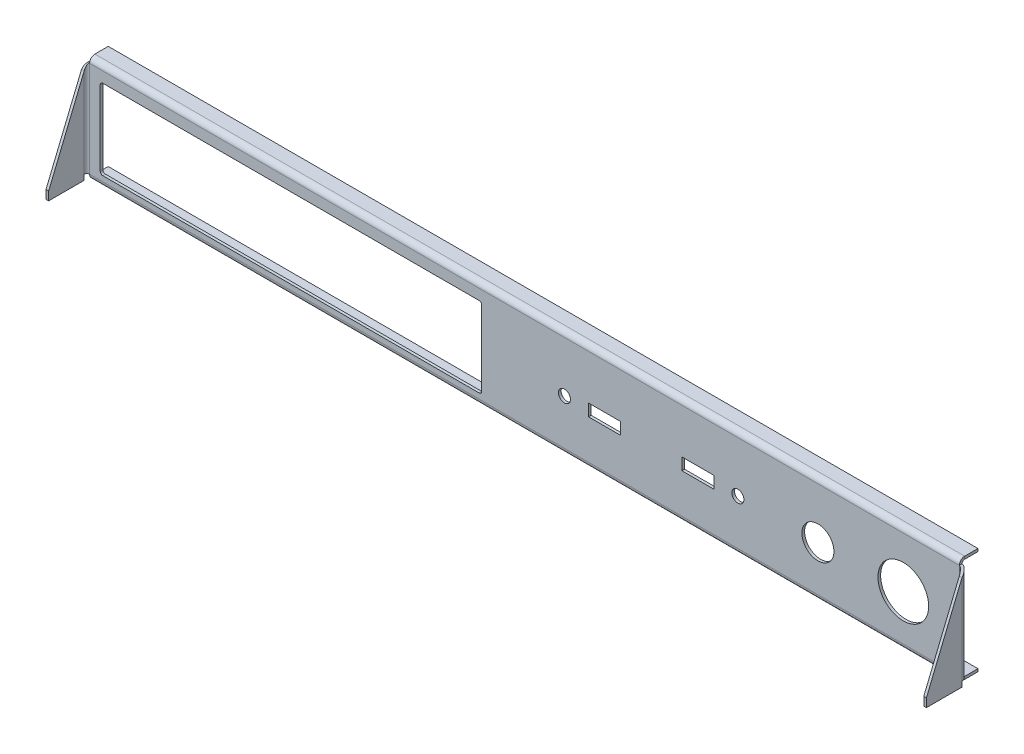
ISO-10303-21;
HEADER;
FILE_DESCRIPTION(('STEP AP214'),'2;1');
FILE_NAME('part.step','',(''),(''),'','','');
FILE_SCHEMA(('AUTOMOTIVE_DESIGN { 1 0 10303 214 1 1 1 1 }'));
ENDSEC;
DATA;
#1=APPLICATION_CONTEXT('core data for automotive mechanical design processes');
#2=APPLICATION_PROTOCOL_DEFINITION('international standard','automotive_design',2000,#1);
#3=PRODUCT_CONTEXT('',#1,'mechanical');
#4=PRODUCT('Part','Part','',(#3));
#5=PRODUCT_RELATED_PRODUCT_CATEGORY('part','',(#4));
#6=PRODUCT_DEFINITION_FORMATION('','',#4);
#7=PRODUCT_DEFINITION_CONTEXT('part definition',#1,'design');
#8=PRODUCT_DEFINITION('design','',#6,#7);
#9=PRODUCT_DEFINITION_SHAPE('','',#8);
#10=(LENGTH_UNIT() NAMED_UNIT(*) SI_UNIT(.MILLI.,.METRE.));
#11=(NAMED_UNIT(*) PLANE_ANGLE_UNIT() SI_UNIT($,.RADIAN.));
#12=(NAMED_UNIT(*) SI_UNIT($,.STERADIAN.) SOLID_ANGLE_UNIT());
#13=UNCERTAINTY_MEASURE_WITH_UNIT(LENGTH_MEASURE(1.E-05),#10,'distance_accuracy_value','');
#14=(GEOMETRIC_REPRESENTATION_CONTEXT(3) GLOBAL_UNCERTAINTY_ASSIGNED_CONTEXT((#13)) GLOBAL_UNIT_ASSIGNED_CONTEXT((#10,
#11,#12)) REPRESENTATION_CONTEXT('',''));
#15=CARTESIAN_POINT('',(0.,0.,0.));
#16=DIRECTION('',(0.,0.,1.));
#17=DIRECTION('',(1.,0.,0.));
#18=AXIS2_PLACEMENT_3D('',#15,#16,#17);
#19=CARTESIAN_POINT('',(163.,31.1428246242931,2.));
#20=CARTESIAN_POINT('',(163.,31.1428246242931,2.33333333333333));
#21=CARTESIAN_POINT('',(163.,31.1428246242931,2.66666666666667));
#22=CARTESIAN_POINT('',(163.,31.1428246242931,3.));
#23=CARTESIAN_POINT('',(161.,31.1428246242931,2.));
#24=CARTESIAN_POINT('',(160.333333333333,31.1428246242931,2.33333333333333));
#25=CARTESIAN_POINT('',(159.666666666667,31.1428246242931,2.66666666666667));
#26=CARTESIAN_POINT('',(159.,31.1428246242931,3.));
#27=CARTESIAN_POINT('',(161.,36.,0.));
#28=CARTESIAN_POINT('',(160.333333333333,36.,-0.333333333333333));
#29=CARTESIAN_POINT('',(159.666666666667,36.,-0.666666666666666));
#30=CARTESIAN_POINT('',(159.,36.,-1.));
#31=CARTESIAN_POINT('',(163.,36.,0.));
#32=CARTESIAN_POINT('',(163.,36.,-0.333333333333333));
#33=CARTESIAN_POINT('',(163.,36.,-0.666666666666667));
#34=CARTESIAN_POINT('',(163.,36.,-1.));
#35=CARTESIAN_POINT('',(165.,36.,0.));
#36=CARTESIAN_POINT('',(165.666666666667,36.,-0.333333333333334));
#37=CARTESIAN_POINT('',(166.333333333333,36.,-0.666666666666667));
#38=CARTESIAN_POINT('',(167.,36.,-1.));
#39=CARTESIAN_POINT('',(165.,31.1428246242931,2.));
#40=CARTESIAN_POINT('',(165.666666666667,31.1428246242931,2.33333333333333));
#41=CARTESIAN_POINT('',(166.333333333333,31.1428246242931,2.66666666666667));
#42=CARTESIAN_POINT('',(167.,31.1428246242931,3.));
#43=CARTESIAN_POINT('',(163.,31.1428246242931,2.));
#44=CARTESIAN_POINT('',(163.,31.1428246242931,2.33333333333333));
#45=CARTESIAN_POINT('',(163.,31.1428246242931,2.66666666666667));
#46=CARTESIAN_POINT('',(163.,31.1428246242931,3.));
#47=(BOUNDED_SURFACE() B_SPLINE_SURFACE(3,3,((#19,#20,#21,#22),(#23,#24,#25,#26),(#27,#28,#29,
#30),(#31,#32,#33,#34),(#35,#36,#37,#38),(#39,#40,#41,#42),(#43,#44,#45,#46)),.UNSPECIFIED.,.T.,
.F.,.F.) B_SPLINE_SURFACE_WITH_KNOTS((4,3,4),(4,4),(0.,0.5,1.),(0.,1.),
.UNSPECIFIED.) GEOMETRIC_REPRESENTATION_ITEM() RATIONAL_B_SPLINE_SURFACE(((1.,1.,1.,1.),
(0.333333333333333,0.333333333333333,0.333333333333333,0.333333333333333),(0.333333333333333,
0.333333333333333,0.333333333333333,0.333333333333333),(1.,1.,1.,1.),(0.333333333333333,
0.333333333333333,0.333333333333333,0.333333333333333),(0.333333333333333,0.333333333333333,
0.333333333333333,0.333333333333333),(1.,1.,1.,1.))) REPRESENTATION_ITEM('') SURFACE());
#48=DIRECTION('',(0.,0.,-1.));
#49=VECTOR('',#48,1.);
#50=CARTESIAN_POINT('',(163.,36.,0.));
#51=LINE('',#50,#49);
#52=CARTESIAN_POINT('',(163.,36.,0.));
#53=VERTEX_POINT('',#52);
#54=CARTESIAN_POINT('',(163.,36.,-1.));
#55=VERTEX_POINT('',#54);
#56=EDGE_CURVE('E602',#53,#55,#51,.T.);
#57=CARTESIAN_POINT('',(163.,33.5714123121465,1.));
#58=DIRECTION('',(0.,-0.380747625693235,-0.924678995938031));
#59=DIRECTION('',(0.,-0.924678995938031,0.380747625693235));
#60=AXIS2_PLACEMENT_3D('',#57,#58,#59);
#61=ELLIPSE('',#60,2.62641165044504,1.);
#62=CARTESIAN_POINT('',(164.,33.5714123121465,1.));
#63=VERTEX_POINT('',#62);
#64=EDGE_CURVE('E518',#53,#63,#61,.T.);
#65=DIRECTION('',(1.,0.,0.));
#66=VECTOR('',#65,1.);
#67=CARTESIAN_POINT('',(164.,33.5714123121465,1.));
#68=LINE('',#67,#66);
#69=CARTESIAN_POINT('',(165.,33.5714123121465,1.));
#70=VERTEX_POINT('',#69);
#71=EDGE_CURVE('E600',#63,#70,#68,.T.);
#72=CARTESIAN_POINT('',(163.,33.5714123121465,1.));
#73=DIRECTION('',(0.,-0.635704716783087,-0.771932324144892));
#74=DIRECTION('',(0.,-0.771932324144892,0.635704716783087));
#75=AXIS2_PLACEMENT_3D('',#72,#73,#74);
#76=ELLIPSE('',#75,3.14611477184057,2.);
#77=EDGE_CURVE('E549',#55,#70,#76,.T.);
#78=ORIENTED_EDGE('',*,*,#56,.F.);
#79=ORIENTED_EDGE('',*,*,#64,.T.);
#80=ORIENTED_EDGE('',*,*,#71,.T.);
#81=ORIENTED_EDGE('',*,*,#77,.F.);
#82=EDGE_LOOP('',(#78,#79,#80,#81));
#83=FACE_BOUND('',#82,.T.);
#84=ADVANCED_FACE('F79',(#83),#47,.T.);
#85=CARTESIAN_POINT('',(164.,36.,0.));
#86=DIRECTION('',(0.,0.380747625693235,0.924678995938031));
#87=DIRECTION('',(0.,-0.924678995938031,0.380747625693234));
#88=AXIS2_PLACEMENT_3D('',#85,#86,#87);
#89=PLANE('',#88);
#90=ORIENTED_EDGE('',*,*,#71,.F.);
#91=DIRECTION('',(0.,-0.924678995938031,0.380747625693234));
#92=VECTOR('',#91,1.);
#93=CARTESIAN_POINT('',(164.,36.,0.));
#94=LINE('',#93,#92);
#95=CARTESIAN_POINT('',(164.,1.21429384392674,14.3234301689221));
#96=VERTEX_POINT('',#95);
#97=EDGE_CURVE('E136',#63,#96,#94,.T.);
#98=ORIENTED_EDGE('',*,*,#97,.T.);
#99=DIRECTION('',(1.,0.,0.));
#100=VECTOR('',#99,1.);
#101=CARTESIAN_POINT('',(164.,1.21429384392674,14.3234301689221));
#102=LINE('',#101,#100);
#103=CARTESIAN_POINT('',(165.,1.21429384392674,14.3234301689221));
#104=VERTEX_POINT('',#103);
#105=EDGE_CURVE('E83',#96,#104,#102,.T.);
#106=ORIENTED_EDGE('',*,*,#105,.T.);
#107=DIRECTION('',(0.,-0.924678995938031,0.380747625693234));
#108=VECTOR('',#107,1.);
#109=CARTESIAN_POINT('',(165.,36.,0.));
#110=LINE('',#109,#108);
#111=EDGE_CURVE('E542',#70,#104,#110,.T.);
#112=ORIENTED_EDGE('',*,*,#111,.F.);
#113=EDGE_LOOP('',(#90,#98,#106,#112));
#114=FACE_BOUND('',#113,.T.);
#115=ADVANCED_FACE('F649',(#114),#89,.T.);
#116=CARTESIAN_POINT('',(163.,0.,1.));
#117=DIRECTION('',(0.,1.,0.));
#118=DIRECTION('',(0.,0.,1.));
#119=AXIS2_PLACEMENT_3D('',#116,#117,#118);
#120=PLANE('',#119);
#121=DIRECTION('',(1.,0.,0.));
#122=VECTOR('',#121,1.);
#123=CARTESIAN_POINT('',(164.,0.,1.));
#124=LINE('',#123,#122);
#125=CARTESIAN_POINT('',(164.,0.,1.));
#126=VERTEX_POINT('',#125);
#127=CARTESIAN_POINT('',(165.,0.,1.));
#128=VERTEX_POINT('',#127);
#129=EDGE_CURVE('E597',#126,#128,#124,.T.);
#130=ORIENTED_EDGE('',*,*,#129,.F.);
#131=CARTESIAN_POINT('',(163.,0.,1.));
#132=DIRECTION('',(0.,-1.,0.));
#133=DIRECTION('',(0.,0.,-1.));
#134=AXIS2_PLACEMENT_3D('',#131,#132,#133);
#135=CIRCLE('',#134,1.);
#136=CARTESIAN_POINT('',(163.,0.,0.));
#137=VERTEX_POINT('',#136);
#138=EDGE_CURVE('E580',#126,#137,#135,.F.);
#139=ORIENTED_EDGE('',*,*,#138,.T.);
#140=DIRECTION('',(0.,0.,-1.));
#141=VECTOR('',#140,1.);
#142=CARTESIAN_POINT('',(163.,0.,0.));
#143=LINE('',#142,#141);
#144=CARTESIAN_POINT('',(163.,0.,-1.));
#145=VERTEX_POINT('',#144);
#146=EDGE_CURVE('E595',#137,#145,#143,.T.);
#147=ORIENTED_EDGE('',*,*,#146,.T.);
#148=CARTESIAN_POINT('',(163.,0.,1.));
#149=DIRECTION('',(0.,-1.,0.));
#150=DIRECTION('',(0.,0.,-1.));
#151=AXIS2_PLACEMENT_3D('',#148,#149,#150);
#152=CIRCLE('',#151,2.);
#153=EDGE_CURVE('E546',#128,#145,#152,.F.);
#154=ORIENTED_EDGE('',*,*,#153,.F.);
#155=EDGE_LOOP('',(#130,#139,#147,#154));
#156=FACE_BOUND('',#155,.T.);
#157=ADVANCED_FACE('F655',(#156),#120,.F.);
#158=CARTESIAN_POINT('',(-163.,0.,1.));
#159=DIRECTION('',(0.,-1.,0.));
#160=DIRECTION('',(0.,0.,-1.));
#161=AXIS2_PLACEMENT_3D('',#158,#159,#160);
#162=PLANE('',#161);
#163=DIRECTION('',(0.,0.,-1.));
#164=VECTOR('',#163,1.);
#165=CARTESIAN_POINT('',(-163.,0.,0.));
#166=LINE('',#165,#164);
#167=CARTESIAN_POINT('',(-163.,0.,0.));
#168=VERTEX_POINT('',#167);
#169=CARTESIAN_POINT('',(-163.,0.,-1.));
#170=VERTEX_POINT('',#169);
#171=EDGE_CURVE('E592',#168,#170,#166,.T.);
#172=ORIENTED_EDGE('',*,*,#171,.F.);
#173=CARTESIAN_POINT('',(-163.,0.,1.));
#174=DIRECTION('',(0.,1.,0.));
#175=DIRECTION('',(0.,0.,1.));
#176=AXIS2_PLACEMENT_3D('',#173,#174,#175);
#177=CIRCLE('',#176,1.);
#178=CARTESIAN_POINT('',(-164.,0.,1.));
#179=VERTEX_POINT('',#178);
#180=EDGE_CURVE('E561',#168,#179,#177,.T.);
#181=ORIENTED_EDGE('',*,*,#180,.T.);
#182=DIRECTION('',(-1.,0.,0.));
#183=VECTOR('',#182,1.);
#184=CARTESIAN_POINT('',(-164.,0.,1.));
#185=LINE('',#184,#183);
#186=CARTESIAN_POINT('',(-165.,0.,1.));
#187=VERTEX_POINT('',#186);
#188=EDGE_CURVE('E287',#179,#187,#185,.T.);
#189=ORIENTED_EDGE('',*,*,#188,.T.);
#190=CARTESIAN_POINT('',(-163.,0.,1.));
#191=DIRECTION('',(0.,1.,0.));
#192=DIRECTION('',(0.,0.,1.));
#193=AXIS2_PLACEMENT_3D('',#190,#191,#192);
#194=CIRCLE('',#193,2.);
#195=EDGE_CURVE('E539',#170,#187,#194,.T.);
#196=ORIENTED_EDGE('',*,*,#195,.F.);
#197=EDGE_LOOP('',(#172,#181,#189,#196));
#198=FACE_BOUND('',#197,.T.);
#199=ADVANCED_FACE('F685',(#198),#162,.T.);
#200=CARTESIAN_POINT('',(-164.,36.,0.));
#201=DIRECTION('',(0.,0.380747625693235,0.924678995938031));
#202=DIRECTION('',(0.,-0.924678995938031,0.380747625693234));
#203=AXIS2_PLACEMENT_3D('',#200,#201,#202);
#204=PLANE('',#203);
#205=DIRECTION('',(-1.,0.,0.));
#206=VECTOR('',#205,1.);
#207=CARTESIAN_POINT('',(-164.,1.21429384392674,14.3234301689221));
#208=LINE('',#207,#206);
#209=CARTESIAN_POINT('',(-164.,1.21429384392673,14.3234301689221));
#210=VERTEX_POINT('',#209);
#211=CARTESIAN_POINT('',(-165.,1.21429384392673,14.3234301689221));
#212=VERTEX_POINT('',#211);
#213=EDGE_CURVE('E285',#210,#212,#208,.T.);
#214=ORIENTED_EDGE('',*,*,#213,.F.);
#215=DIRECTION('',(0.,-0.924678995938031,0.380747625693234));
#216=VECTOR('',#215,1.);
#217=CARTESIAN_POINT('',(-164.,36.,0.));
#218=LINE('',#217,#216);
#219=CARTESIAN_POINT('',(-164.,33.5714123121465,1.));
#220=VERTEX_POINT('',#219);
#221=EDGE_CURVE('E567',#220,#210,#218,.T.);
#222=ORIENTED_EDGE('',*,*,#221,.F.);
#223=DIRECTION('',(-1.,0.,0.));
#224=VECTOR('',#223,1.);
#225=CARTESIAN_POINT('',(-164.,33.5714123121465,1.));
#226=LINE('',#225,#224);
#227=CARTESIAN_POINT('',(-165.,33.5714123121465,1.));
#228=VERTEX_POINT('',#227);
#229=EDGE_CURVE('E288',#220,#228,#226,.T.);
#230=ORIENTED_EDGE('',*,*,#229,.T.);
#231=DIRECTION('',(0.,-0.924678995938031,0.380747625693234));
#232=VECTOR('',#231,1.);
#233=CARTESIAN_POINT('',(-165.,36.,0.));
#234=LINE('',#233,#232);
#235=EDGE_CURVE('E531',#228,#212,#234,.T.);
#236=ORIENTED_EDGE('',*,*,#235,.T.);
#237=EDGE_LOOP('',(#214,#222,#230,#236));
#238=FACE_BOUND('',#237,.T.);
#239=ADVANCED_FACE('F672',(#238),#204,.T.);
#240=CARTESIAN_POINT('',(-163.,36.,-1.));
#241=CARTESIAN_POINT('',(-163.,36.,-0.666666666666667));
#242=CARTESIAN_POINT('',(-163.,36.,-0.333333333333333));
#243=CARTESIAN_POINT('',(-163.,36.,0.));
#244=CARTESIAN_POINT('',(-159.,36.,-1.));
#245=CARTESIAN_POINT('',(-159.666666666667,36.,-0.666666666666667));
#246=CARTESIAN_POINT('',(-160.333333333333,36.,-0.333333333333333));
#247=CARTESIAN_POINT('',(-161.,36.,0.));
#248=CARTESIAN_POINT('',(-159.,31.1428246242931,3.));
#249=CARTESIAN_POINT('',(-159.666666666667,31.1428246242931,2.66666666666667));
#250=CARTESIAN_POINT('',(-160.333333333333,31.1428246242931,2.33333333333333));
#251=CARTESIAN_POINT('',(-161.,31.1428246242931,2.));
#252=CARTESIAN_POINT('',(-163.,31.1428246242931,3.));
#253=CARTESIAN_POINT('',(-163.,31.1428246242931,2.66666666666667));
#254=CARTESIAN_POINT('',(-163.,31.1428246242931,2.33333333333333));
#255=CARTESIAN_POINT('',(-163.,31.1428246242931,2.));
#256=CARTESIAN_POINT('',(-167.,31.1428246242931,3.));
#257=CARTESIAN_POINT('',(-166.333333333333,31.1428246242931,2.66666666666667));
#258=CARTESIAN_POINT('',(-165.666666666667,31.1428246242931,2.33333333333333));
#259=CARTESIAN_POINT('',(-165.,31.1428246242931,2.));
#260=CARTESIAN_POINT('',(-167.,36.,-1.));
#261=CARTESIAN_POINT('',(-166.333333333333,36.,-0.666666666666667));
#262=CARTESIAN_POINT('',(-165.666666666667,36.,-0.333333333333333));
#263=CARTESIAN_POINT('',(-165.,36.,0.));
#264=CARTESIAN_POINT('',(-163.,36.,-1.));
#265=CARTESIAN_POINT('',(-163.,36.,-0.666666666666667));
#266=CARTESIAN_POINT('',(-163.,36.,-0.333333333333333));
#267=CARTESIAN_POINT('',(-163.,36.,0.));
#268=(BOUNDED_SURFACE() B_SPLINE_SURFACE(3,3,((#240,#241,#242,#243),(#244,#245,#246,#247),(#248,
#249,#250,#251),(#252,#253,#254,#255),(#256,#257,#258,#259),(#260,#261,#262,#263),(#264,#265,
#266,#267)),.UNSPECIFIED.,.T.,.F.,.F.) B_SPLINE_SURFACE_WITH_KNOTS((4,3,4),(4,4),(0.,0.5,1.),
(0.,1.),.UNSPECIFIED.) GEOMETRIC_REPRESENTATION_ITEM() RATIONAL_B_SPLINE_SURFACE(((1.,1.,1.,1.),
(0.333333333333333,0.333333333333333,0.333333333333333,0.333333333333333),(0.333333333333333,
0.333333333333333,0.333333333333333,0.333333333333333),(1.,1.,1.,1.),(0.333333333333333,
0.333333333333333,0.333333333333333,0.333333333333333),(0.333333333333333,0.333333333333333,
0.333333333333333,0.333333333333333),(1.,1.,1.,1.))) REPRESENTATION_ITEM('') SURFACE());
#269=CARTESIAN_POINT('',(-163.,33.5714123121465,1.));
#270=DIRECTION('',(0.,0.380747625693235,0.924678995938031));
#271=DIRECTION('',(0.,0.924678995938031,-0.380747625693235));
#272=AXIS2_PLACEMENT_3D('',#269,#270,#271);
#273=ELLIPSE('',#272,2.62641165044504,1.);
#274=CARTESIAN_POINT('',(-163.,36.,0.));
#275=VERTEX_POINT('',#274);
#276=EDGE_CURVE('E577',#220,#275,#273,.F.);
#277=DIRECTION('',(0.,0.,-1.));
#278=VECTOR('',#277,1.);
#279=CARTESIAN_POINT('',(-163.,36.,0.));
#280=LINE('',#279,#278);
#281=CARTESIAN_POINT('',(-163.,36.,-1.));
#282=VERTEX_POINT('',#281);
#283=EDGE_CURVE('E605',#275,#282,#280,.T.);
#284=CARTESIAN_POINT('',(-163.,33.5714123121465,1.));
#285=DIRECTION('',(0.,0.635704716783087,0.771932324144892));
#286=DIRECTION('',(0.,0.771932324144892,-0.635704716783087));
#287=AXIS2_PLACEMENT_3D('',#284,#285,#286);
#288=ELLIPSE('',#287,3.14611477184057,2.);
#289=EDGE_CURVE('E543',#228,#282,#288,.F.);
#290=ORIENTED_EDGE('',*,*,#276,.T.);
#291=ORIENTED_EDGE('',*,*,#283,.T.);
#292=ORIENTED_EDGE('',*,*,#289,.F.);
#293=ORIENTED_EDGE('',*,*,#229,.F.);
#294=EDGE_LOOP('',(#290,#291,#292,#293));
#295=FACE_BOUND('',#294,.T.);
#296=ADVANCED_FACE('F662',(#295),#268,.F.);
#297=CARTESIAN_POINT('',(-165.,0.,0.));
#298=DIRECTION('',(1.,0.,0.));
#299=DIRECTION('',(0.,0.,-1.));
#300=AXIS2_PLACEMENT_3D('',#297,#298,#299);
#301=PLANE('',#300);
#302=ORIENTED_EDGE('',*,*,#235,.F.);
#303=DIRECTION('',(0.,1.,0.));
#304=VECTOR('',#303,1.);
#305=CARTESIAN_POINT('',(-165.,0.,1.));
#306=LINE('',#305,#304);
#307=EDGE_CURVE('E524',#228,#187,#306,.F.);
#308=ORIENTED_EDGE('',*,*,#307,.T.);
#309=DIRECTION('',(0.,-1.,0.));
#310=VECTOR('',#309,1.);
#311=CARTESIAN_POINT('',(-165.,0.,1.));
#312=LINE('',#311,#310);
#313=CARTESIAN_POINT('',(-165.,-2.,1.));
#314=VERTEX_POINT('',#313);
#315=EDGE_CURVE('E323',#187,#314,#312,.T.);
#316=ORIENTED_EDGE('',*,*,#315,.T.);
#317=DIRECTION('',(0.,0.,1.));
#318=VECTOR('',#317,1.);
#319=CARTESIAN_POINT('',(-165.,-2.,1.));
#320=LINE('',#319,#318);
#321=CARTESIAN_POINT('',(-165.,-2.,14.3234301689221));
#322=VERTEX_POINT('',#321);
#323=EDGE_CURVE('E284',#314,#322,#320,.T.);
#324=ORIENTED_EDGE('',*,*,#323,.T.);
#325=DIRECTION('',(0.,1.,0.));
#326=VECTOR('',#325,1.);
#327=CARTESIAN_POINT('',(-165.,0.,14.3234301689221));
#328=LINE('',#327,#326);
#329=EDGE_CURVE('E280',#322,#212,#328,.T.);
#330=ORIENTED_EDGE('',*,*,#329,.T.);
#331=EDGE_LOOP('',(#302,#308,#316,#324,#330));
#332=FACE_BOUND('',#331,.T.);
#333=ADVANCED_FACE('F671',(#332),#301,.F.);
#334=CARTESIAN_POINT('',(164.,0.,-1.));
#335=DIRECTION('',(0.,0.,1.));
#336=DIRECTION('',(1.,0.,0.));
#337=AXIS2_PLACEMENT_3D('',#334,#335,#336);
#338=PLANE('',#337);
#339=CARTESIAN_POINT('',(80.,17.,-1.));
#340=DIRECTION('',(0.,0.,1.));
#341=DIRECTION('',(1.,0.,0.));
#342=AXIS2_PLACEMENT_3D('',#339,#340,#341);
#343=CIRCLE('',#342,2.25);
#344=CARTESIAN_POINT('',(82.25,17.,-1.));
#345=VERTEX_POINT('',#344);
#346=EDGE_CURVE('E883',#345,#345,#343,.T.);
#347=ORIENTED_EDGE('',*,*,#346,.T.);
#348=EDGE_LOOP('',(#347));
#349=FACE_BOUND('',#348,.T.);
#350=CARTESIAN_POINT('',(15.,17.,-1.));
#351=DIRECTION('',(0.,0.,1.));
#352=DIRECTION('',(1.,0.,0.));
#353=AXIS2_PLACEMENT_3D('',#350,#351,#352);
#354=CIRCLE('',#353,2.25000000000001);
#355=CARTESIAN_POINT('',(17.25,17.,-1.));
#356=VERTEX_POINT('',#355);
#357=EDGE_CURVE('E300',#356,#356,#354,.T.);
#358=ORIENTED_EDGE('',*,*,#357,.T.);
#359=EDGE_LOOP('',(#358));
#360=FACE_BOUND('',#359,.T.);
#361=DIRECTION('',(1.,0.,0.));
#362=VECTOR('',#361,1.);
#363=CARTESIAN_POINT('',(59.,14.75,-1.));
#364=LINE('',#363,#362);
#365=CARTESIAN_POINT('',(59.,14.75,-1.));
#366=VERTEX_POINT('',#365);
#367=CARTESIAN_POINT('',(71.,14.75,-1.));
#368=VERTEX_POINT('',#367);
#369=EDGE_CURVE('E440',#366,#368,#364,.T.);
#370=ORIENTED_EDGE('',*,*,#369,.T.);
#371=DIRECTION('',(0.,1.,0.));
#372=VECTOR('',#371,1.);
#373=CARTESIAN_POINT('',(71.,19.25,-1.));
#374=LINE('',#373,#372);
#375=CARTESIAN_POINT('',(71.,19.25,-1.));
#376=VERTEX_POINT('',#375);
#377=EDGE_CURVE('E430',#368,#376,#374,.T.);
#378=ORIENTED_EDGE('',*,*,#377,.T.);
#379=DIRECTION('',(-1.,0.,0.));
#380=VECTOR('',#379,1.);
#381=CARTESIAN_POINT('',(59.,19.25,-1.));
#382=LINE('',#381,#380);
#383=CARTESIAN_POINT('',(59.,19.25,-1.));
#384=VERTEX_POINT('',#383);
#385=EDGE_CURVE('E433',#376,#384,#382,.T.);
#386=ORIENTED_EDGE('',*,*,#385,.T.);
#387=DIRECTION('',(0.,-1.,0.));
#388=VECTOR('',#387,1.);
#389=CARTESIAN_POINT('',(59.,19.25,-1.));
#390=LINE('',#389,#388);
#391=EDGE_CURVE('E437',#384,#366,#390,.T.);
#392=ORIENTED_EDGE('',*,*,#391,.T.);
#393=EDGE_LOOP('',(#370,#378,#386,#392));
#394=FACE_BOUND('',#393,.T.);
#395=DIRECTION('',(1.,0.,0.));
#396=VECTOR('',#395,1.);
#397=CARTESIAN_POINT('',(24.,14.75,-1.));
#398=LINE('',#397,#396);
#399=CARTESIAN_POINT('',(24.,14.75,-1.));
#400=VERTEX_POINT('',#399);
#401=CARTESIAN_POINT('',(36.,14.75,-1.));
#402=VERTEX_POINT('',#401);
#403=EDGE_CURVE('E475',#400,#402,#398,.T.);
#404=ORIENTED_EDGE('',*,*,#403,.T.);
#405=DIRECTION('',(0.,1.,0.));
#406=VECTOR('',#405,1.);
#407=CARTESIAN_POINT('',(36.,19.25,-1.));
#408=LINE('',#407,#406);
#409=CARTESIAN_POINT('',(36.,19.25,-1.));
#410=VERTEX_POINT('',#409);
#411=EDGE_CURVE('E465',#402,#410,#408,.T.);
#412=ORIENTED_EDGE('',*,*,#411,.T.);
#413=DIRECTION('',(-1.,0.,0.));
#414=VECTOR('',#413,1.);
#415=CARTESIAN_POINT('',(24.,19.25,-1.));
#416=LINE('',#415,#414);
#417=CARTESIAN_POINT('',(24.,19.25,-1.));
#418=VERTEX_POINT('',#417);
#419=EDGE_CURVE('E468',#410,#418,#416,.T.);
#420=ORIENTED_EDGE('',*,*,#419,.T.);
#421=DIRECTION('',(0.,-1.,0.));
#422=VECTOR('',#421,1.);
#423=CARTESIAN_POINT('',(24.,19.25,-1.));
#424=LINE('',#423,#422);
#425=EDGE_CURVE('E472',#418,#400,#424,.T.);
#426=ORIENTED_EDGE('',*,*,#425,.T.);
#427=EDGE_LOOP('',(#404,#412,#420,#426));
#428=FACE_BOUND('',#427,.T.);
#429=CARTESIAN_POINT('',(110.,17.,-1.));
#430=DIRECTION('',(0.,0.,1.));
#431=DIRECTION('',(1.,0.,0.));
#432=AXIS2_PLACEMENT_3D('',#429,#430,#431);
#433=CIRCLE('',#432,6.);
#434=CARTESIAN_POINT('',(116.,17.,-1.));
#435=VERTEX_POINT('',#434);
#436=EDGE_CURVE('E495',#435,#435,#433,.T.);
#437=ORIENTED_EDGE('',*,*,#436,.T.);
#438=EDGE_LOOP('',(#437));
#439=FACE_BOUND('',#438,.T.);
#440=CARTESIAN_POINT('',(142.,17.,-1.));
#441=DIRECTION('',(0.,0.,1.));
#442=DIRECTION('',(1.,0.,0.));
#443=AXIS2_PLACEMENT_3D('',#440,#441,#442);
#444=CIRCLE('',#443,9.50000000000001);
#445=CARTESIAN_POINT('',(151.5,17.,-1.));
#446=VERTEX_POINT('',#445);
#447=EDGE_CURVE('E501',#446,#446,#444,.T.);
#448=ORIENTED_EDGE('',*,*,#447,.T.);
#449=EDGE_LOOP('',(#448));
#450=FACE_BOUND('',#449,.T.);
#451=DIRECTION('',(0.,1.,0.));
#452=VECTOR('',#451,1.);
#453=CARTESIAN_POINT('',(-16.,32.,-1.));
#454=LINE('',#453,#452);
#455=CARTESIAN_POINT('',(-16.,3.,-1.));
#456=VERTEX_POINT('',#455);
#457=CARTESIAN_POINT('',(-16.,31.,-1.));
#458=VERTEX_POINT('',#457);
#459=EDGE_CURVE('E513',#456,#458,#454,.T.);
#460=ORIENTED_EDGE('',*,*,#459,.T.);
#461=CARTESIAN_POINT('',(-17.,31.,-1.));
#462=DIRECTION('',(0.,0.,1.));
#463=DIRECTION('',(1.,0.,0.));
#464=AXIS2_PLACEMENT_3D('',#461,#462,#463);
#465=CIRCLE('',#464,1.);
#466=CARTESIAN_POINT('',(-17.,32.,-1.));
#467=VERTEX_POINT('',#466);
#468=EDGE_CURVE('E14',#458,#467,#465,.T.);
#469=ORIENTED_EDGE('',*,*,#468,.T.);
#470=DIRECTION('',(-1.,0.,0.));
#471=VECTOR('',#470,1.);
#472=CARTESIAN_POINT('',(-159.,32.,-1.));
#473=LINE('',#472,#471);
#474=CARTESIAN_POINT('',(-158.,32.,-1.));
#475=VERTEX_POINT('',#474);
#476=EDGE_CURVE('E515',#467,#475,#473,.T.);
#477=ORIENTED_EDGE('',*,*,#476,.T.);
#478=CARTESIAN_POINT('',(-158.,31.,-1.));
#479=DIRECTION('',(0.,0.,1.));
#480=DIRECTION('',(1.,0.,0.));
#481=AXIS2_PLACEMENT_3D('',#478,#479,#480);
#482=CIRCLE('',#481,1.);
#483=CARTESIAN_POINT('',(-159.,31.,-1.));
#484=VERTEX_POINT('',#483);
#485=EDGE_CURVE('E271',#475,#484,#482,.T.);
#486=ORIENTED_EDGE('',*,*,#485,.T.);
#487=DIRECTION('',(0.,-1.,0.));
#488=VECTOR('',#487,1.);
#489=CARTESIAN_POINT('',(-159.,32.,-1.));
#490=LINE('',#489,#488);
#491=CARTESIAN_POINT('',(-159.,3.,-1.));
#492=VERTEX_POINT('',#491);
#493=EDGE_CURVE('E507',#484,#492,#490,.T.);
#494=ORIENTED_EDGE('',*,*,#493,.T.);
#495=CARTESIAN_POINT('',(-158.,3.,-1.));
#496=DIRECTION('',(0.,0.,1.));
#497=DIRECTION('',(1.,0.,0.));
#498=AXIS2_PLACEMENT_3D('',#495,#496,#497);
#499=CIRCLE('',#498,1.);
#500=CARTESIAN_POINT('',(-158.,2.,-1.));
#501=VERTEX_POINT('',#500);
#502=EDGE_CURVE('E275',#492,#501,#499,.T.);
#503=ORIENTED_EDGE('',*,*,#502,.T.);
#504=DIRECTION('',(1.,0.,0.));
#505=VECTOR('',#504,1.);
#506=CARTESIAN_POINT('',(-159.,2.,-1.));
#507=LINE('',#506,#505);
#508=CARTESIAN_POINT('',(-17.,2.,-1.));
#509=VERTEX_POINT('',#508);
#510=EDGE_CURVE('E510',#501,#509,#507,.T.);
#511=ORIENTED_EDGE('',*,*,#510,.T.);
#512=CARTESIAN_POINT('',(-17.,3.,-1.));
#513=DIRECTION('',(0.,0.,1.));
#514=DIRECTION('',(1.,0.,0.));
#515=AXIS2_PLACEMENT_3D('',#512,#513,#514);
#516=CIRCLE('',#515,1.);
#517=EDGE_CURVE('E251',#509,#456,#516,.T.);
#518=ORIENTED_EDGE('',*,*,#517,.T.);
#519=EDGE_LOOP('',(#460,#469,#477,#486,#494,#503,#511,#518));
#520=FACE_BOUND('',#519,.T.);
#521=DIRECTION('',(1.,0.,0.));
#522=VECTOR('',#521,1.);
#523=CARTESIAN_POINT('',(164.,36.,-1.));
#524=LINE('',#523,#522);
#525=EDGE_CURVE('E545',#55,#282,#524,.F.);
#526=ORIENTED_EDGE('',*,*,#525,.F.);
#527=DIRECTION('',(0.,1.,0.));
#528=VECTOR('',#527,1.);
#529=CARTESIAN_POINT('',(163.,0.,-1.));
#530=LINE('',#529,#528);
#531=EDGE_CURVE('E532',#55,#145,#530,.F.);
#532=ORIENTED_EDGE('',*,*,#531,.T.);
#533=DIRECTION('',(1.,0.,0.));
#534=VECTOR('',#533,1.);
#535=CARTESIAN_POINT('',(164.,0.,-1.));
#536=LINE('',#535,#534);
#537=EDGE_CURVE('E538',#145,#170,#536,.F.);
#538=ORIENTED_EDGE('',*,*,#537,.T.);
#539=DIRECTION('',(0.,1.,0.));
#540=VECTOR('',#539,1.);
#541=CARTESIAN_POINT('',(-163.,0.,-1.));
#542=LINE('',#541,#540);
#543=EDGE_CURVE('E528',#170,#282,#542,.T.);
#544=ORIENTED_EDGE('',*,*,#543,.T.);
#545=EDGE_LOOP('',(#526,#532,#538,#544));
#546=FACE_BOUND('',#545,.T.);
#547=ADVANCED_FACE('F626',(#349,#360,#394,#428,#439,#450,#520,#546),#338,.F.);
#548=CARTESIAN_POINT('',(165.,0.,0.));
#549=DIRECTION('',(1.,0.,0.));
#550=DIRECTION('',(0.,0.,-1.));
#551=AXIS2_PLACEMENT_3D('',#548,#549,#550);
#552=PLANE('',#551);
#553=ORIENTED_EDGE('',*,*,#111,.T.);
#554=DIRECTION('',(0.,-1.,0.));
#555=VECTOR('',#554,1.);
#556=CARTESIAN_POINT('',(165.,0.,14.3234301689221));
#557=LINE('',#556,#555);
#558=CARTESIAN_POINT('',(165.,-2.,14.3234301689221));
#559=VERTEX_POINT('',#558);
#560=EDGE_CURVE('E296',#104,#559,#557,.T.);
#561=ORIENTED_EDGE('',*,*,#560,.T.);
#562=DIRECTION('',(0.,0.,-1.));
#563=VECTOR('',#562,1.);
#564=CARTESIAN_POINT('',(165.,-2.,14.8234301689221));
#565=LINE('',#564,#563);
#566=CARTESIAN_POINT('',(165.,-2.,1.));
#567=VERTEX_POINT('',#566);
#568=EDGE_CURVE('E299',#559,#567,#565,.T.);
#569=ORIENTED_EDGE('',*,*,#568,.T.);
#570=DIRECTION('',(0.,1.,0.));
#571=VECTOR('',#570,1.);
#572=CARTESIAN_POINT('',(165.,0.,1.));
#573=LINE('',#572,#571);
#574=EDGE_CURVE('E307',#567,#128,#573,.T.);
#575=ORIENTED_EDGE('',*,*,#574,.T.);
#576=DIRECTION('',(0.,1.,0.));
#577=VECTOR('',#576,1.);
#578=CARTESIAN_POINT('',(165.,0.,1.));
#579=LINE('',#578,#577);
#580=EDGE_CURVE('E527',#128,#70,#579,.T.);
#581=ORIENTED_EDGE('',*,*,#580,.T.);
#582=EDGE_LOOP('',(#553,#561,#569,#575,#581));
#583=FACE_BOUND('',#582,.T.);
#584=ADVANCED_FACE('F842',(#583),#552,.T.);
#585=CARTESIAN_POINT('',(-163.,0.,1.));
#586=DIRECTION('',(0.,1.,0.));
#587=DIRECTION('',(0.,0.,1.));
#588=AXIS2_PLACEMENT_3D('',#585,#586,#587);
#589=CYLINDRICAL_SURFACE('',#588,2.);
#590=ORIENTED_EDGE('',*,*,#195,.T.);
#591=ORIENTED_EDGE('',*,*,#307,.F.);
#592=ORIENTED_EDGE('',*,*,#289,.T.);
#593=ORIENTED_EDGE('',*,*,#543,.F.);
#594=EDGE_LOOP('',(#590,#591,#592,#593));
#595=FACE_BOUND('',#594,.T.);
#596=ADVANCED_FACE('F714',(#595),#589,.T.);
#597=CARTESIAN_POINT('',(163.,0.,1.));
#598=DIRECTION('',(0.,-1.,0.));
#599=DIRECTION('',(0.,0.,-1.));
#600=AXIS2_PLACEMENT_3D('',#597,#598,#599);
#601=CYLINDRICAL_SURFACE('',#600,2.);
#602=ORIENTED_EDGE('',*,*,#153,.T.);
#603=ORIENTED_EDGE('',*,*,#531,.F.);
#604=ORIENTED_EDGE('',*,*,#77,.T.);
#605=ORIENTED_EDGE('',*,*,#580,.F.);
#606=EDGE_LOOP('',(#602,#603,#604,#605));
#607=FACE_BOUND('',#606,.T.);
#608=ADVANCED_FACE('F848',(#607),#601,.T.);
#609=CARTESIAN_POINT('',(-164.,0.,0.));
#610=DIRECTION('',(1.,0.,0.));
#611=DIRECTION('',(0.,0.,-1.));
#612=AXIS2_PLACEMENT_3D('',#609,#610,#611);
#613=PLANE('',#612);
#614=ORIENTED_EDGE('',*,*,#221,.T.);
#615=DIRECTION('',(0.,1.,0.));
#616=VECTOR('',#615,1.);
#617=CARTESIAN_POINT('',(-164.,0.,14.3234301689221));
#618=LINE('',#617,#616);
#619=CARTESIAN_POINT('',(-164.,-2.,14.3234301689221));
#620=VERTEX_POINT('',#619);
#621=EDGE_CURVE('E289',#620,#210,#618,.T.);
#622=ORIENTED_EDGE('',*,*,#621,.F.);
#623=DIRECTION('',(0.,0.,1.));
#624=VECTOR('',#623,1.);
#625=CARTESIAN_POINT('',(-164.,-2.,1.));
#626=LINE('',#625,#624);
#627=CARTESIAN_POINT('',(-164.,-2.,1.));
#628=VERTEX_POINT('',#627);
#629=EDGE_CURVE('E292',#628,#620,#626,.T.);
#630=ORIENTED_EDGE('',*,*,#629,.F.);
#631=DIRECTION('',(0.,-1.,0.));
#632=VECTOR('',#631,1.);
#633=CARTESIAN_POINT('',(-164.,0.,1.));
#634=LINE('',#633,#632);
#635=EDGE_CURVE('E283',#179,#628,#634,.T.);
#636=ORIENTED_EDGE('',*,*,#635,.F.);
#637=DIRECTION('',(0.,1.,0.));
#638=VECTOR('',#637,1.);
#639=CARTESIAN_POINT('',(-164.,0.,1.));
#640=LINE('',#639,#638);
#641=EDGE_CURVE('E573',#220,#179,#640,.F.);
#642=ORIENTED_EDGE('',*,*,#641,.F.);
#643=EDGE_LOOP('',(#614,#622,#630,#636,#642));
#644=FACE_BOUND('',#643,.T.);
#645=ADVANCED_FACE('F701',(#644),#613,.T.);
#646=CARTESIAN_POINT('',(164.,0.,0.));
#647=DIRECTION('',(0.,0.,1.));
#648=DIRECTION('',(1.,0.,0.));
#649=AXIS2_PLACEMENT_3D('',#646,#647,#648);
#650=PLANE('',#649);
#651=CARTESIAN_POINT('',(80.,17.,0.));
#652=DIRECTION('',(0.,0.,1.));
#653=DIRECTION('',(1.,0.,0.));
#654=AXIS2_PLACEMENT_3D('',#651,#652,#653);
#655=CIRCLE('',#654,2.25);
#656=CARTESIAN_POINT('',(82.25,17.,0.));
#657=VERTEX_POINT('',#656);
#658=EDGE_CURVE('E886',#657,#657,#655,.T.);
#659=ORIENTED_EDGE('',*,*,#658,.F.);
#660=EDGE_LOOP('',(#659));
#661=FACE_BOUND('',#660,.T.);
#662=CARTESIAN_POINT('',(15.,17.,0.));
#663=DIRECTION('',(0.,0.,1.));
#664=DIRECTION('',(1.,0.,0.));
#665=AXIS2_PLACEMENT_3D('',#662,#663,#664);
#666=CIRCLE('',#665,2.25000000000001);
#667=CARTESIAN_POINT('',(17.25,17.,0.));
#668=VERTEX_POINT('',#667);
#669=EDGE_CURVE('E880',#668,#668,#666,.T.);
#670=ORIENTED_EDGE('',*,*,#669,.F.);
#671=EDGE_LOOP('',(#670));
#672=FACE_BOUND('',#671,.T.);
#673=DIRECTION('',(0.,1.,0.));
#674=VECTOR('',#673,1.);
#675=CARTESIAN_POINT('',(71.,19.25,0.));
#676=LINE('',#675,#674);
#677=CARTESIAN_POINT('',(71.,14.75,0.));
#678=VERTEX_POINT('',#677);
#679=CARTESIAN_POINT('',(71.,19.25,0.));
#680=VERTEX_POINT('',#679);
#681=EDGE_CURVE('E421',#678,#680,#676,.T.);
#682=ORIENTED_EDGE('',*,*,#681,.F.);
#683=DIRECTION('',(1.,0.,0.));
#684=VECTOR('',#683,1.);
#685=CARTESIAN_POINT('',(59.,14.75,0.));
#686=LINE('',#685,#684);
#687=CARTESIAN_POINT('',(59.,14.75,0.));
#688=VERTEX_POINT('',#687);
#689=EDGE_CURVE('E434',#688,#678,#686,.T.);
#690=ORIENTED_EDGE('',*,*,#689,.F.);
#691=DIRECTION('',(0.,-1.,0.));
#692=VECTOR('',#691,1.);
#693=CARTESIAN_POINT('',(59.,19.25,0.));
#694=LINE('',#693,#692);
#695=CARTESIAN_POINT('',(59.,19.25,0.));
#696=VERTEX_POINT('',#695);
#697=EDGE_CURVE('E448',#696,#688,#694,.T.);
#698=ORIENTED_EDGE('',*,*,#697,.F.);
#699=DIRECTION('',(-1.,0.,0.));
#700=VECTOR('',#699,1.);
#701=CARTESIAN_POINT('',(59.,19.25,0.));
#702=LINE('',#701,#700);
#703=EDGE_CURVE('E445',#680,#696,#702,.T.);
#704=ORIENTED_EDGE('',*,*,#703,.F.);
#705=EDGE_LOOP('',(#682,#690,#698,#704));
#706=FACE_BOUND('',#705,.T.);
#707=DIRECTION('',(0.,1.,0.));
#708=VECTOR('',#707,1.);
#709=CARTESIAN_POINT('',(36.,19.25,0.));
#710=LINE('',#709,#708);
#711=CARTESIAN_POINT('',(36.,14.75,0.));
#712=VERTEX_POINT('',#711);
#713=CARTESIAN_POINT('',(36.,19.25,0.));
#714=VERTEX_POINT('',#713);
#715=EDGE_CURVE('E456',#712,#714,#710,.T.);
#716=ORIENTED_EDGE('',*,*,#715,.F.);
#717=DIRECTION('',(1.,0.,0.));
#718=VECTOR('',#717,1.);
#719=CARTESIAN_POINT('',(24.,14.75,0.));
#720=LINE('',#719,#718);
#721=CARTESIAN_POINT('',(24.,14.75,0.));
#722=VERTEX_POINT('',#721);
#723=EDGE_CURVE('E469',#722,#712,#720,.T.);
#724=ORIENTED_EDGE('',*,*,#723,.F.);
#725=DIRECTION('',(0.,-1.,0.));
#726=VECTOR('',#725,1.);
#727=CARTESIAN_POINT('',(24.,19.25,0.));
#728=LINE('',#727,#726);
#729=CARTESIAN_POINT('',(24.,19.25,0.));
#730=VERTEX_POINT('',#729);
#731=EDGE_CURVE('E483',#730,#722,#728,.T.);
#732=ORIENTED_EDGE('',*,*,#731,.F.);
#733=DIRECTION('',(-1.,0.,0.));
#734=VECTOR('',#733,1.);
#735=CARTESIAN_POINT('',(24.,19.25,0.));
#736=LINE('',#735,#734);
#737=EDGE_CURVE('E480',#714,#730,#736,.T.);
#738=ORIENTED_EDGE('',*,*,#737,.F.);
#739=EDGE_LOOP('',(#716,#724,#732,#738));
#740=FACE_BOUND('',#739,.T.);
#741=CARTESIAN_POINT('',(110.,17.,0.));
#742=DIRECTION('',(0.,0.,1.));
#743=DIRECTION('',(1.,0.,0.));
#744=AXIS2_PLACEMENT_3D('',#741,#742,#743);
#745=CIRCLE('',#744,6.);
#746=CARTESIAN_POINT('',(116.,17.,0.));
#747=VERTEX_POINT('',#746);
#748=EDGE_CURVE('E488',#747,#747,#745,.T.);
#749=ORIENTED_EDGE('',*,*,#748,.F.);
#750=EDGE_LOOP('',(#749));
#751=FACE_BOUND('',#750,.T.);
#752=CARTESIAN_POINT('',(142.,17.,0.));
#753=DIRECTION('',(0.,0.,1.));
#754=DIRECTION('',(1.,0.,0.));
#755=AXIS2_PLACEMENT_3D('',#752,#753,#754);
#756=CIRCLE('',#755,9.50000000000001);
#757=CARTESIAN_POINT('',(151.5,17.,0.));
#758=VERTEX_POINT('',#757);
#759=EDGE_CURVE('E498',#758,#758,#756,.T.);
#760=ORIENTED_EDGE('',*,*,#759,.F.);
#761=EDGE_LOOP('',(#760));
#762=FACE_BOUND('',#761,.T.);
#763=DIRECTION('',(0.,-1.,0.));
#764=VECTOR('',#763,1.);
#765=CARTESIAN_POINT('',(-159.,32.,0.));
#766=LINE('',#765,#764);
#767=CARTESIAN_POINT('',(-159.,31.,0.));
#768=VERTEX_POINT('',#767);
#769=CARTESIAN_POINT('',(-159.,3.,0.));
#770=VERTEX_POINT('',#769);
#771=EDGE_CURVE('E504',#768,#770,#766,.T.);
#772=ORIENTED_EDGE('',*,*,#771,.F.);
#773=CARTESIAN_POINT('',(-158.,31.,0.));
#774=DIRECTION('',(0.,0.,1.));
#775=DIRECTION('',(1.,0.,0.));
#776=AXIS2_PLACEMENT_3D('',#773,#774,#775);
#777=CIRCLE('',#776,1.);
#778=CARTESIAN_POINT('',(-158.,32.,0.));
#779=VERTEX_POINT('',#778);
#780=EDGE_CURVE('E263',#768,#779,#777,.F.);
#781=ORIENTED_EDGE('',*,*,#780,.T.);
#782=DIRECTION('',(-1.,0.,0.));
#783=VECTOR('',#782,1.);
#784=CARTESIAN_POINT('',(-159.,32.,0.));
#785=LINE('',#784,#783);
#786=CARTESIAN_POINT('',(-17.,32.,0.));
#787=VERTEX_POINT('',#786);
#788=EDGE_CURVE('E247',#787,#779,#785,.T.);
#789=ORIENTED_EDGE('',*,*,#788,.F.);
#790=CARTESIAN_POINT('',(-17.,31.,0.));
#791=DIRECTION('',(0.,0.,1.));
#792=DIRECTION('',(1.,0.,0.));
#793=AXIS2_PLACEMENT_3D('',#790,#791,#792);
#794=CIRCLE('',#793,1.);
#795=CARTESIAN_POINT('',(-16.,31.,0.));
#796=VERTEX_POINT('',#795);
#797=EDGE_CURVE('E89',#787,#796,#794,.F.);
#798=ORIENTED_EDGE('',*,*,#797,.T.);
#799=DIRECTION('',(0.,1.,0.));
#800=VECTOR('',#799,1.);
#801=CARTESIAN_POINT('',(-16.,32.,0.));
#802=LINE('',#801,#800);
#803=CARTESIAN_POINT('',(-16.,3.,0.));
#804=VERTEX_POINT('',#803);
#805=EDGE_CURVE('E245',#804,#796,#802,.T.);
#806=ORIENTED_EDGE('',*,*,#805,.F.);
#807=CARTESIAN_POINT('',(-17.,3.,0.));
#808=DIRECTION('',(0.,0.,1.));
#809=DIRECTION('',(1.,0.,0.));
#810=AXIS2_PLACEMENT_3D('',#807,#808,#809);
#811=CIRCLE('',#810,1.);
#812=CARTESIAN_POINT('',(-17.,2.,0.));
#813=VERTEX_POINT('',#812);
#814=EDGE_CURVE('E277',#804,#813,#811,.F.);
#815=ORIENTED_EDGE('',*,*,#814,.T.);
#816=DIRECTION('',(1.,0.,0.));
#817=VECTOR('',#816,1.);
#818=CARTESIAN_POINT('',(-159.,2.,0.));
#819=LINE('',#818,#817);
#820=CARTESIAN_POINT('',(-158.,2.,0.));
#821=VERTEX_POINT('',#820);
#822=EDGE_CURVE('E257',#821,#813,#819,.T.);
#823=ORIENTED_EDGE('',*,*,#822,.F.);
#824=CARTESIAN_POINT('',(-158.,3.,0.));
#825=DIRECTION('',(0.,0.,1.));
#826=DIRECTION('',(1.,0.,0.));
#827=AXIS2_PLACEMENT_3D('',#824,#825,#826);
#828=CIRCLE('',#827,1.);
#829=EDGE_CURVE('E273',#821,#770,#828,.F.);
#830=ORIENTED_EDGE('',*,*,#829,.T.);
#831=EDGE_LOOP('',(#772,#781,#789,#798,#806,#815,#823,#830));
#832=FACE_BOUND('',#831,.T.);
#833=DIRECTION('',(-1.,0.,0.));
#834=VECTOR('',#833,1.);
#835=CARTESIAN_POINT('',(164.,36.,0.));
#836=LINE('',#835,#834);
#837=EDGE_CURVE('E560',#53,#275,#836,.T.);
#838=ORIENTED_EDGE('',*,*,#837,.T.);
#839=DIRECTION('',(0.,1.,0.));
#840=VECTOR('',#839,1.);
#841=CARTESIAN_POINT('',(-163.,0.,0.));
#842=LINE('',#841,#840);
#843=EDGE_CURVE('E570',#168,#275,#842,.T.);
#844=ORIENTED_EDGE('',*,*,#843,.F.);
#845=DIRECTION('',(-1.,0.,0.));
#846=VECTOR('',#845,1.);
#847=CARTESIAN_POINT('',(164.,0.,0.));
#848=LINE('',#847,#846);
#849=EDGE_CURVE('E564',#137,#168,#848,.T.);
#850=ORIENTED_EDGE('',*,*,#849,.F.);
#851=DIRECTION('',(0.,1.,0.));
#852=VECTOR('',#851,1.);
#853=CARTESIAN_POINT('',(163.,0.,0.));
#854=LINE('',#853,#852);
#855=EDGE_CURVE('E554',#53,#137,#854,.F.);
#856=ORIENTED_EDGE('',*,*,#855,.F.);
#857=EDGE_LOOP('',(#838,#844,#850,#856));
#858=FACE_BOUND('',#857,.T.);
#859=ADVANCED_FACE('F243',(#661,#672,#706,#740,#751,#762,#832,#858),#650,.T.);
#860=CARTESIAN_POINT('',(164.,0.,0.));
#861=DIRECTION('',(1.,0.,0.));
#862=DIRECTION('',(0.,0.,-1.));
#863=AXIS2_PLACEMENT_3D('',#860,#861,#862);
#864=PLANE('',#863);
#865=DIRECTION('',(0.,1.,0.));
#866=VECTOR('',#865,1.);
#867=CARTESIAN_POINT('',(164.,36.,1.));
#868=LINE('',#867,#866);
#869=EDGE_CURVE('E576',#126,#63,#868,.T.);
#870=ORIENTED_EDGE('',*,*,#869,.F.);
#871=DIRECTION('',(0.,1.,0.));
#872=VECTOR('',#871,1.);
#873=CARTESIAN_POINT('',(164.,0.,1.));
#874=LINE('',#873,#872);
#875=CARTESIAN_POINT('',(164.,-2.,1.));
#876=VERTEX_POINT('',#875);
#877=EDGE_CURVE('E303',#876,#126,#874,.T.);
#878=ORIENTED_EDGE('',*,*,#877,.F.);
#879=DIRECTION('',(0.,0.,-1.));
#880=VECTOR('',#879,1.);
#881=CARTESIAN_POINT('',(164.,-2.,14.8234301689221));
#882=LINE('',#881,#880);
#883=CARTESIAN_POINT('',(164.,-2.,14.3234301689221));
#884=VERTEX_POINT('',#883);
#885=EDGE_CURVE('E306',#884,#876,#882,.T.);
#886=ORIENTED_EDGE('',*,*,#885,.F.);
#887=DIRECTION('',(0.,-1.,0.));
#888=VECTOR('',#887,1.);
#889=CARTESIAN_POINT('',(164.,0.,14.3234301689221));
#890=LINE('',#889,#888);
#891=EDGE_CURVE('E304',#96,#884,#890,.T.);
#892=ORIENTED_EDGE('',*,*,#891,.F.);
#893=ORIENTED_EDGE('',*,*,#97,.F.);
#894=EDGE_LOOP('',(#870,#878,#886,#892,#893));
#895=FACE_BOUND('',#894,.T.);
#896=ADVANCED_FACE('F809',(#895),#864,.F.);
#897=CARTESIAN_POINT('',(-163.,0.,1.));
#898=DIRECTION('',(0.,1.,0.));
#899=DIRECTION('',(0.,0.,1.));
#900=AXIS2_PLACEMENT_3D('',#897,#898,#899);
#901=CYLINDRICAL_SURFACE('',#900,1.);
#902=ORIENTED_EDGE('',*,*,#180,.F.);
#903=ORIENTED_EDGE('',*,*,#843,.T.);
#904=ORIENTED_EDGE('',*,*,#276,.F.);
#905=ORIENTED_EDGE('',*,*,#641,.T.);
#906=EDGE_LOOP('',(#902,#903,#904,#905));
#907=FACE_BOUND('',#906,.T.);
#908=ADVANCED_FACE('F696',(#907),#901,.F.);
#909=CARTESIAN_POINT('',(163.,0.,1.));
#910=DIRECTION('',(0.,-1.,0.));
#911=DIRECTION('',(0.,0.,-1.));
#912=AXIS2_PLACEMENT_3D('',#909,#910,#911);
#913=CYLINDRICAL_SURFACE('',#912,1.);
#914=ORIENTED_EDGE('',*,*,#138,.F.);
#915=ORIENTED_EDGE('',*,*,#869,.T.);
#916=ORIENTED_EDGE('',*,*,#64,.F.);
#917=ORIENTED_EDGE('',*,*,#855,.T.);
#918=EDGE_LOOP('',(#914,#915,#916,#917));
#919=FACE_BOUND('',#918,.T.);
#920=ADVANCED_FACE('F838',(#919),#913,.F.);
#921=CARTESIAN_POINT('',(-159.,32.,-1.));
#922=DIRECTION('',(-1.,0.,0.));
#923=DIRECTION('',(0.,0.,1.));
#924=AXIS2_PLACEMENT_3D('',#921,#922,#923);
#925=PLANE('',#924);
#926=ORIENTED_EDGE('',*,*,#493,.F.);
#927=DIRECTION('',(0.,0.,1.));
#928=VECTOR('',#927,1.);
#929=CARTESIAN_POINT('',(-159.,31.,0.));
#930=LINE('',#929,#928);
#931=EDGE_CURVE('E611',#484,#768,#930,.T.);
#932=ORIENTED_EDGE('',*,*,#931,.T.);
#933=ORIENTED_EDGE('',*,*,#771,.T.);
#934=DIRECTION('',(0.,0.,1.));
#935=VECTOR('',#934,1.);
#936=CARTESIAN_POINT('',(-159.,3.,-1.));
#937=LINE('',#936,#935);
#938=EDGE_CURVE('E608',#770,#492,#937,.F.);
#939=ORIENTED_EDGE('',*,*,#938,.T.);
#940=EDGE_LOOP('',(#926,#932,#933,#939));
#941=FACE_BOUND('',#940,.T.);
#942=ADVANCED_FACE('F634',(#941),#925,.F.);
#943=CARTESIAN_POINT('',(-159.,32.,-1.));
#944=DIRECTION('',(0.,1.,0.));
#945=DIRECTION('',(0.,0.,1.));
#946=AXIS2_PLACEMENT_3D('',#943,#944,#945);
#947=PLANE('',#946);
#948=ORIENTED_EDGE('',*,*,#788,.T.);
#949=DIRECTION('',(0.,0.,1.));
#950=VECTOR('',#949,1.);
#951=CARTESIAN_POINT('',(-158.,32.,-1.));
#952=LINE('',#951,#950);
#953=EDGE_CURVE('E616',#779,#475,#952,.F.);
#954=ORIENTED_EDGE('',*,*,#953,.T.);
#955=ORIENTED_EDGE('',*,*,#476,.F.);
#956=DIRECTION('',(0.,0.,1.));
#957=VECTOR('',#956,1.);
#958=CARTESIAN_POINT('',(-17.,32.,0.));
#959=LINE('',#958,#957);
#960=EDGE_CURVE('E614',#467,#787,#959,.T.);
#961=ORIENTED_EDGE('',*,*,#960,.T.);
#962=EDGE_LOOP('',(#948,#954,#955,#961));
#963=FACE_BOUND('',#962,.T.);
#964=ADVANCED_FACE('F831',(#963),#947,.F.);
#965=CARTESIAN_POINT('',(-16.,32.,-1.));
#966=DIRECTION('',(1.,0.,0.));
#967=DIRECTION('',(0.,1.,0.));
#968=AXIS2_PLACEMENT_3D('',#965,#966,#967);
#969=PLANE('',#968);
#970=ORIENTED_EDGE('',*,*,#459,.F.);
#971=DIRECTION('',(0.,0.,1.));
#972=VECTOR('',#971,1.);
#973=CARTESIAN_POINT('',(-16.,3.,0.));
#974=LINE('',#973,#972);
#975=EDGE_CURVE('E256',#456,#804,#974,.T.);
#976=ORIENTED_EDGE('',*,*,#975,.T.);
#977=ORIENTED_EDGE('',*,*,#805,.T.);
#978=DIRECTION('',(0.,0.,1.));
#979=VECTOR('',#978,1.);
#980=CARTESIAN_POINT('',(-16.,31.,-1.));
#981=LINE('',#980,#979);
#982=EDGE_CURVE('E98',#796,#458,#981,.F.);
#983=ORIENTED_EDGE('',*,*,#982,.T.);
#984=EDGE_LOOP('',(#970,#976,#977,#983));
#985=FACE_BOUND('',#984,.T.);
#986=ADVANCED_FACE('F254',(#985),#969,.F.);
#987=CARTESIAN_POINT('',(-159.,2.,-1.));
#988=DIRECTION('',(0.,-1.,0.));
#989=DIRECTION('',(1.,0.,0.));
#990=AXIS2_PLACEMENT_3D('',#987,#988,#989);
#991=PLANE('',#990);
#992=ORIENTED_EDGE('',*,*,#510,.F.);
#993=DIRECTION('',(0.,0.,1.));
#994=VECTOR('',#993,1.);
#995=CARTESIAN_POINT('',(-158.,2.,0.));
#996=LINE('',#995,#994);
#997=EDGE_CURVE('E261',#501,#821,#996,.T.);
#998=ORIENTED_EDGE('',*,*,#997,.T.);
#999=ORIENTED_EDGE('',*,*,#822,.T.);
#1000=DIRECTION('',(0.,0.,1.));
#1001=VECTOR('',#1000,1.);
#1002=CARTESIAN_POINT('',(-17.,2.,-1.));
#1003=LINE('',#1002,#1001);
#1004=EDGE_CURVE('E266',#813,#509,#1003,.F.);
#1005=ORIENTED_EDGE('',*,*,#1004,.T.);
#1006=EDGE_LOOP('',(#992,#998,#999,#1005));
#1007=FACE_BOUND('',#1006,.T.);
#1008=ADVANCED_FACE('F620',(#1007),#991,.F.);
#1009=CARTESIAN_POINT('',(142.,17.,-1.));
#1010=DIRECTION('',(0.,0.,1.));
#1011=DIRECTION('',(1.,0.,0.));
#1012=AXIS2_PLACEMENT_3D('',#1009,#1010,#1011);
#1013=CYLINDRICAL_SURFACE('',#1012,9.50000000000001);
#1014=ORIENTED_EDGE('',*,*,#447,.F.);
#1015=EDGE_LOOP('',(#1014));
#1016=FACE_BOUND('',#1015,.T.);
#1017=ORIENTED_EDGE('',*,*,#759,.T.);
#1018=EDGE_LOOP('',(#1017));
#1019=FACE_BOUND('',#1018,.T.);
#1020=ADVANCED_FACE('F816',(#1016,#1019),#1013,.F.);
#1021=CARTESIAN_POINT('',(110.,17.,-1.));
#1022=DIRECTION('',(0.,0.,1.));
#1023=DIRECTION('',(1.,0.,0.));
#1024=AXIS2_PLACEMENT_3D('',#1021,#1022,#1023);
#1025=CYLINDRICAL_SURFACE('',#1024,6.);
#1026=ORIENTED_EDGE('',*,*,#436,.F.);
#1027=EDGE_LOOP('',(#1026));
#1028=FACE_BOUND('',#1027,.T.);
#1029=ORIENTED_EDGE('',*,*,#748,.T.);
#1030=EDGE_LOOP('',(#1029));
#1031=FACE_BOUND('',#1030,.T.);
#1032=ADVANCED_FACE('F818',(#1028,#1031),#1025,.F.);
#1033=CARTESIAN_POINT('',(36.,19.25,-1.));
#1034=DIRECTION('',(1.,0.,0.));
#1035=DIRECTION('',(0.,0.,-1.));
#1036=AXIS2_PLACEMENT_3D('',#1033,#1034,#1035);
#1037=PLANE('',#1036);
#1038=ORIENTED_EDGE('',*,*,#715,.T.);
#1039=DIRECTION('',(0.,0.,1.));
#1040=VECTOR('',#1039,1.);
#1041=CARTESIAN_POINT('',(36.,19.25,-1.));
#1042=LINE('',#1041,#1040);
#1043=EDGE_CURVE('E478',#410,#714,#1042,.T.);
#1044=ORIENTED_EDGE('',*,*,#1043,.F.);
#1045=ORIENTED_EDGE('',*,*,#411,.F.);
#1046=DIRECTION('',(0.,0.,1.));
#1047=VECTOR('',#1046,1.);
#1048=CARTESIAN_POINT('',(36.,14.75,-1.));
#1049=LINE('',#1048,#1047);
#1050=EDGE_CURVE('E148',#402,#712,#1049,.T.);
#1051=ORIENTED_EDGE('',*,*,#1050,.T.);
#1052=EDGE_LOOP('',(#1038,#1044,#1045,#1051));
#1053=FACE_BOUND('',#1052,.T.);
#1054=ADVANCED_FACE('F793',(#1053),#1037,.F.);
#1055=CARTESIAN_POINT('',(24.,14.75,-1.));
#1056=DIRECTION('',(0.,-1.,0.));
#1057=DIRECTION('',(0.,0.,-1.));
#1058=AXIS2_PLACEMENT_3D('',#1055,#1056,#1057);
#1059=PLANE('',#1058);
#1060=ORIENTED_EDGE('',*,*,#723,.T.);
#1061=ORIENTED_EDGE('',*,*,#1050,.F.);
#1062=ORIENTED_EDGE('',*,*,#403,.F.);
#1063=DIRECTION('',(0.,0.,1.));
#1064=VECTOR('',#1063,1.);
#1065=CARTESIAN_POINT('',(24.,14.75,-1.));
#1066=LINE('',#1065,#1064);
#1067=EDGE_CURVE('E489',#400,#722,#1066,.T.);
#1068=ORIENTED_EDGE('',*,*,#1067,.T.);
#1069=EDGE_LOOP('',(#1060,#1061,#1062,#1068));
#1070=FACE_BOUND('',#1069,.T.);
#1071=ADVANCED_FACE('F801',(#1070),#1059,.F.);
#1072=CARTESIAN_POINT('',(24.,19.25,-1.));
#1073=DIRECTION('',(-1.,0.,0.));
#1074=DIRECTION('',(0.,0.,1.));
#1075=AXIS2_PLACEMENT_3D('',#1072,#1073,#1074);
#1076=PLANE('',#1075);
#1077=ORIENTED_EDGE('',*,*,#731,.T.);
#1078=ORIENTED_EDGE('',*,*,#1067,.F.);
#1079=ORIENTED_EDGE('',*,*,#425,.F.);
#1080=DIRECTION('',(0.,0.,1.));
#1081=VECTOR('',#1080,1.);
#1082=CARTESIAN_POINT('',(24.,19.25,-1.));
#1083=LINE('',#1082,#1081);
#1084=EDGE_CURVE('E491',#418,#730,#1083,.T.);
#1085=ORIENTED_EDGE('',*,*,#1084,.T.);
#1086=EDGE_LOOP('',(#1077,#1078,#1079,#1085));
#1087=FACE_BOUND('',#1086,.T.);
#1088=ADVANCED_FACE('F805',(#1087),#1076,.F.);
#1089=CARTESIAN_POINT('',(24.,19.25,-1.));
#1090=DIRECTION('',(0.,1.,0.));
#1091=DIRECTION('',(0.,0.,1.));
#1092=AXIS2_PLACEMENT_3D('',#1089,#1090,#1091);
#1093=PLANE('',#1092);
#1094=ORIENTED_EDGE('',*,*,#737,.T.);
#1095=ORIENTED_EDGE('',*,*,#1084,.F.);
#1096=ORIENTED_EDGE('',*,*,#419,.F.);
#1097=ORIENTED_EDGE('',*,*,#1043,.T.);
#1098=EDGE_LOOP('',(#1094,#1095,#1096,#1097));
#1099=FACE_BOUND('',#1098,.T.);
#1100=ADVANCED_FACE('F798',(#1099),#1093,.F.);
#1101=CARTESIAN_POINT('',(71.,19.25,-1.));
#1102=DIRECTION('',(1.,0.,0.));
#1103=DIRECTION('',(0.,0.,-1.));
#1104=AXIS2_PLACEMENT_3D('',#1101,#1102,#1103);
#1105=PLANE('',#1104);
#1106=ORIENTED_EDGE('',*,*,#681,.T.);
#1107=DIRECTION('',(0.,0.,1.));
#1108=VECTOR('',#1107,1.);
#1109=CARTESIAN_POINT('',(71.,19.25,-1.));
#1110=LINE('',#1109,#1108);
#1111=EDGE_CURVE('E443',#376,#680,#1110,.T.);
#1112=ORIENTED_EDGE('',*,*,#1111,.F.);
#1113=ORIENTED_EDGE('',*,*,#377,.F.);
#1114=DIRECTION('',(0.,0.,1.));
#1115=VECTOR('',#1114,1.);
#1116=CARTESIAN_POINT('',(71.,14.75,-1.));
#1117=LINE('',#1116,#1115);
#1118=EDGE_CURVE('E453',#368,#678,#1117,.T.);
#1119=ORIENTED_EDGE('',*,*,#1118,.T.);
#1120=EDGE_LOOP('',(#1106,#1112,#1113,#1119));
#1121=FACE_BOUND('',#1120,.T.);
#1122=ADVANCED_FACE('F900',(#1121),#1105,.F.);
#1123=CARTESIAN_POINT('',(59.,14.75,-1.));
#1124=DIRECTION('',(0.,-1.,0.));
#1125=DIRECTION('',(0.,0.,-1.));
#1126=AXIS2_PLACEMENT_3D('',#1123,#1124,#1125);
#1127=PLANE('',#1126);
#1128=ORIENTED_EDGE('',*,*,#689,.T.);
#1129=ORIENTED_EDGE('',*,*,#1118,.F.);
#1130=ORIENTED_EDGE('',*,*,#369,.F.);
#1131=DIRECTION('',(0.,0.,1.));
#1132=VECTOR('',#1131,1.);
#1133=CARTESIAN_POINT('',(59.,14.75,-1.));
#1134=LINE('',#1133,#1132);
#1135=EDGE_CURVE('E457',#366,#688,#1134,.T.);
#1136=ORIENTED_EDGE('',*,*,#1135,.T.);
#1137=EDGE_LOOP('',(#1128,#1129,#1130,#1136));
#1138=FACE_BOUND('',#1137,.T.);
#1139=ADVANCED_FACE('F909',(#1138),#1127,.F.);
#1140=CARTESIAN_POINT('',(59.,19.25,-1.));
#1141=DIRECTION('',(-1.,0.,0.));
#1142=DIRECTION('',(0.,0.,1.));
#1143=AXIS2_PLACEMENT_3D('',#1140,#1141,#1142);
#1144=PLANE('',#1143);
#1145=ORIENTED_EDGE('',*,*,#697,.T.);
#1146=ORIENTED_EDGE('',*,*,#1135,.F.);
#1147=ORIENTED_EDGE('',*,*,#391,.F.);
#1148=DIRECTION('',(0.,0.,1.));
#1149=VECTOR('',#1148,1.);
#1150=CARTESIAN_POINT('',(59.,19.25,-1.));
#1151=LINE('',#1150,#1149);
#1152=EDGE_CURVE('E460',#384,#696,#1151,.T.);
#1153=ORIENTED_EDGE('',*,*,#1152,.T.);
#1154=EDGE_LOOP('',(#1145,#1146,#1147,#1153));
#1155=FACE_BOUND('',#1154,.T.);
#1156=ADVANCED_FACE('F911',(#1155),#1144,.F.);
#1157=CARTESIAN_POINT('',(59.,19.25,-1.));
#1158=DIRECTION('',(0.,1.,0.));
#1159=DIRECTION('',(0.,0.,1.));
#1160=AXIS2_PLACEMENT_3D('',#1157,#1158,#1159);
#1161=PLANE('',#1160);
#1162=ORIENTED_EDGE('',*,*,#703,.T.);
#1163=ORIENTED_EDGE('',*,*,#1152,.F.);
#1164=ORIENTED_EDGE('',*,*,#385,.F.);
#1165=ORIENTED_EDGE('',*,*,#1111,.T.);
#1166=EDGE_LOOP('',(#1162,#1163,#1164,#1165));
#1167=FACE_BOUND('',#1166,.T.);
#1168=ADVANCED_FACE('F904',(#1167),#1161,.F.);
#1169=CARTESIAN_POINT('',(-163.,36.,-1.99999999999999));
#1170=DIRECTION('',(-1.,0.,0.));
#1171=DIRECTION('',(0.,0.,1.));
#1172=AXIS2_PLACEMENT_3D('',#1169,#1170,#1171);
#1173=PLANE('',#1172);
#1174=DIRECTION('',(0.,1.,0.));
#1175=VECTOR('',#1174,1.);
#1176=CARTESIAN_POINT('',(-163.,38.,-1.99999999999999));
#1177=LINE('',#1176,#1175);
#1178=CARTESIAN_POINT('',(-163.,37.,-1.99999999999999));
#1179=VERTEX_POINT('',#1178);
#1180=CARTESIAN_POINT('',(-163.,38.,-1.99999999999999));
#1181=VERTEX_POINT('',#1180);
#1182=EDGE_CURVE('E373',#1179,#1181,#1177,.T.);
#1183=ORIENTED_EDGE('',*,*,#1182,.F.);
#1184=CARTESIAN_POINT('',(-163.,36.,-1.99999999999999));
#1185=DIRECTION('',(1.,0.,0.));
#1186=DIRECTION('',(0.,0.,-1.));
#1187=AXIS2_PLACEMENT_3D('',#1184,#1185,#1186);
#1188=CIRCLE('',#1187,0.999999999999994);
#1189=EDGE_CURVE('E425',#282,#1179,#1188,.F.);
#1190=ORIENTED_EDGE('',*,*,#1189,.F.);
#1191=ORIENTED_EDGE('',*,*,#283,.F.);
#1192=CARTESIAN_POINT('',(-163.,36.,-1.99999999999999));
#1193=DIRECTION('',(1.,0.,0.));
#1194=DIRECTION('',(0.,0.,-1.));
#1195=AXIS2_PLACEMENT_3D('',#1192,#1193,#1194);
#1196=CIRCLE('',#1195,1.99999999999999);
#1197=EDGE_CURVE('E418',#275,#1181,#1196,.F.);
#1198=ORIENTED_EDGE('',*,*,#1197,.T.);
#1199=EDGE_LOOP('',(#1183,#1190,#1191,#1198));
#1200=FACE_BOUND('',#1199,.T.);
#1201=ADVANCED_FACE('F918',(#1200),#1173,.T.);
#1202=CARTESIAN_POINT('',(163.,36.,-1.99999999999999));
#1203=DIRECTION('',(-1.,0.,0.));
#1204=DIRECTION('',(0.,0.,1.));
#1205=AXIS2_PLACEMENT_3D('',#1202,#1203,#1204);
#1206=PLANE('',#1205);
#1207=CARTESIAN_POINT('',(163.,36.,-1.99999999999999));
#1208=DIRECTION('',(1.,0.,0.));
#1209=DIRECTION('',(0.,0.,-1.));
#1210=AXIS2_PLACEMENT_3D('',#1207,#1208,#1209);
#1211=CIRCLE('',#1210,0.999999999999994);
#1212=CARTESIAN_POINT('',(163.,37.,-1.99999999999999));
#1213=VERTEX_POINT('',#1212);
#1214=EDGE_CURVE('E385',#1213,#55,#1211,.T.);
#1215=ORIENTED_EDGE('',*,*,#1214,.F.);
#1216=DIRECTION('',(0.,1.,0.));
#1217=VECTOR('',#1216,1.);
#1218=CARTESIAN_POINT('',(163.,37.,-1.99999999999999));
#1219=LINE('',#1218,#1217);
#1220=CARTESIAN_POINT('',(163.,38.,-1.99999999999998));
#1221=VERTEX_POINT('',#1220);
#1222=EDGE_CURVE('E410',#1213,#1221,#1219,.T.);
#1223=ORIENTED_EDGE('',*,*,#1222,.T.);
#1224=CARTESIAN_POINT('',(163.,36.,-1.99999999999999));
#1225=DIRECTION('',(1.,0.,0.));
#1226=DIRECTION('',(0.,0.,-1.));
#1227=AXIS2_PLACEMENT_3D('',#1224,#1225,#1226);
#1228=CIRCLE('',#1227,1.99999999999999);
#1229=EDGE_CURVE('E422',#1221,#53,#1228,.T.);
#1230=ORIENTED_EDGE('',*,*,#1229,.T.);
#1231=ORIENTED_EDGE('',*,*,#56,.T.);
#1232=EDGE_LOOP('',(#1215,#1223,#1230,#1231));
#1233=FACE_BOUND('',#1232,.T.);
#1234=ADVANCED_FACE('F991',(#1233),#1206,.F.);
#1235=CARTESIAN_POINT('',(163.,36.,-1.99999999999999));
#1236=DIRECTION('',(1.,0.,0.));
#1237=DIRECTION('',(0.,1.,0.));
#1238=AXIS2_PLACEMENT_3D('',#1235,#1236,#1237);
#1239=CYLINDRICAL_SURFACE('',#1238,1.99999999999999);
#1240=ORIENTED_EDGE('',*,*,#837,.F.);
#1241=ORIENTED_EDGE('',*,*,#1229,.F.);
#1242=DIRECTION('',(1.,0.,0.));
#1243=VECTOR('',#1242,1.);
#1244=CARTESIAN_POINT('',(0.,38.,-1.99999999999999));
#1245=LINE('',#1244,#1243);
#1246=EDGE_CURVE('E407',#1181,#1221,#1245,.T.);
#1247=ORIENTED_EDGE('',*,*,#1246,.F.);
#1248=ORIENTED_EDGE('',*,*,#1197,.F.);
#1249=EDGE_LOOP('',(#1240,#1241,#1247,#1248));
#1250=FACE_BOUND('',#1249,.T.);
#1251=ADVANCED_FACE('F1002',(#1250),#1239,.T.);
#1252=CARTESIAN_POINT('',(163.,36.,-1.99999999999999));
#1253=DIRECTION('',(1.,0.,0.));
#1254=DIRECTION('',(0.,1.,0.));
#1255=AXIS2_PLACEMENT_3D('',#1252,#1253,#1254);
#1256=CYLINDRICAL_SURFACE('',#1255,0.999999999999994);
#1257=ORIENTED_EDGE('',*,*,#525,.T.);
#1258=ORIENTED_EDGE('',*,*,#1189,.T.);
#1259=DIRECTION('',(-1.,0.,0.));
#1260=VECTOR('',#1259,1.);
#1261=CARTESIAN_POINT('',(-163.,37.,-1.99999999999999));
#1262=LINE('',#1261,#1260);
#1263=EDGE_CURVE('E413',#1179,#1213,#1262,.F.);
#1264=ORIENTED_EDGE('',*,*,#1263,.T.);
#1265=ORIENTED_EDGE('',*,*,#1214,.T.);
#1266=EDGE_LOOP('',(#1257,#1258,#1264,#1265));
#1267=FACE_BOUND('',#1266,.T.);
#1268=ADVANCED_FACE('F1012',(#1267),#1256,.F.);
#1269=CARTESIAN_POINT('',(163.,38.,-0.999999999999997));
#1270=DIRECTION('',(1.,0.,0.));
#1271=DIRECTION('',(0.,0.,-1.));
#1272=AXIS2_PLACEMENT_3D('',#1269,#1270,#1271);
#1273=PLANE('',#1272);
#1274=DIRECTION('',(0.,0.,1.));
#1275=VECTOR('',#1274,1.);
#1276=CARTESIAN_POINT('',(163.,38.,-0.999999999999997));
#1277=LINE('',#1276,#1275);
#1278=CARTESIAN_POINT('',(163.,38.,-7.));
#1279=VERTEX_POINT('',#1278);
#1280=EDGE_CURVE('E389',#1279,#1221,#1277,.T.);
#1281=ORIENTED_EDGE('',*,*,#1280,.T.);
#1282=ORIENTED_EDGE('',*,*,#1222,.F.);
#1283=DIRECTION('',(0.,0.,-1.));
#1284=VECTOR('',#1283,1.);
#1285=CARTESIAN_POINT('',(163.,37.,1.2490009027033E-13));
#1286=LINE('',#1285,#1284);
#1287=CARTESIAN_POINT('',(163.,37.,-7.));
#1288=VERTEX_POINT('',#1287);
#1289=EDGE_CURVE('E398',#1288,#1213,#1286,.F.);
#1290=ORIENTED_EDGE('',*,*,#1289,.F.);
#1291=DIRECTION('',(0.,-1.,0.));
#1292=VECTOR('',#1291,1.);
#1293=CARTESIAN_POINT('',(163.,38.,-7.));
#1294=LINE('',#1293,#1292);
#1295=EDGE_CURVE('E382',#1279,#1288,#1294,.T.);
#1296=ORIENTED_EDGE('',*,*,#1295,.F.);
#1297=EDGE_LOOP('',(#1281,#1282,#1290,#1296));
#1298=FACE_BOUND('',#1297,.T.);
#1299=ADVANCED_FACE('F1023',(#1298),#1273,.T.);
#1300=CARTESIAN_POINT('',(-163.,38.,-7.));
#1301=DIRECTION('',(-1.,0.,0.));
#1302=DIRECTION('',(0.,0.,1.));
#1303=AXIS2_PLACEMENT_3D('',#1300,#1301,#1302);
#1304=PLANE('',#1303);
#1305=DIRECTION('',(0.,0.,1.));
#1306=VECTOR('',#1305,1.);
#1307=CARTESIAN_POINT('',(-163.,37.,1.2490009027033E-13));
#1308=LINE('',#1307,#1306);
#1309=CARTESIAN_POINT('',(-163.,37.,-7.));
#1310=VERTEX_POINT('',#1309);
#1311=EDGE_CURVE('E404',#1179,#1310,#1308,.F.);
#1312=ORIENTED_EDGE('',*,*,#1311,.F.);
#1313=ORIENTED_EDGE('',*,*,#1182,.T.);
#1314=DIRECTION('',(0.,0.,-1.));
#1315=VECTOR('',#1314,1.);
#1316=CARTESIAN_POINT('',(-163.,38.,-7.));
#1317=LINE('',#1316,#1315);
#1318=CARTESIAN_POINT('',(-163.,38.,-7.));
#1319=VERTEX_POINT('',#1318);
#1320=EDGE_CURVE('E395',#1181,#1319,#1317,.T.);
#1321=ORIENTED_EDGE('',*,*,#1320,.T.);
#1322=DIRECTION('',(0.,-1.,0.));
#1323=VECTOR('',#1322,1.);
#1324=CARTESIAN_POINT('',(-163.,38.,-7.));
#1325=LINE('',#1324,#1323);
#1326=EDGE_CURVE('E386',#1319,#1310,#1325,.T.);
#1327=ORIENTED_EDGE('',*,*,#1326,.T.);
#1328=EDGE_LOOP('',(#1312,#1313,#1321,#1327));
#1329=FACE_BOUND('',#1328,.T.);
#1330=ADVANCED_FACE('F1034',(#1329),#1304,.T.);
#1331=CARTESIAN_POINT('',(0.,38.,1.28391571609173E-13));
#1332=DIRECTION('',(0.,1.,0.));
#1333=DIRECTION('',(0.,0.,1.));
#1334=AXIS2_PLACEMENT_3D('',#1331,#1332,#1333);
#1335=PLANE('',#1334);
#1336=ORIENTED_EDGE('',*,*,#1320,.F.);
#1337=ORIENTED_EDGE('',*,*,#1246,.T.);
#1338=ORIENTED_EDGE('',*,*,#1280,.F.);
#1339=DIRECTION('',(1.,0.,0.));
#1340=VECTOR('',#1339,1.);
#1341=CARTESIAN_POINT('',(163.,38.,-7.));
#1342=LINE('',#1341,#1340);
#1343=EDGE_CURVE('E392',#1319,#1279,#1342,.T.);
#1344=ORIENTED_EDGE('',*,*,#1343,.F.);
#1345=EDGE_LOOP('',(#1336,#1337,#1338,#1344));
#1346=FACE_BOUND('',#1345,.T.);
#1347=ADVANCED_FACE('F1045',(#1346),#1335,.T.);
#1348=CARTESIAN_POINT('',(0.,37.,1.2490009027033E-13));
#1349=DIRECTION('',(0.,1.,0.));
#1350=DIRECTION('',(0.,0.,1.));
#1351=AXIS2_PLACEMENT_3D('',#1348,#1349,#1350);
#1352=PLANE('',#1351);
#1353=ORIENTED_EDGE('',*,*,#1263,.F.);
#1354=ORIENTED_EDGE('',*,*,#1311,.T.);
#1355=DIRECTION('',(-1.,0.,0.));
#1356=VECTOR('',#1355,1.);
#1357=CARTESIAN_POINT('',(0.,37.,-7.));
#1358=LINE('',#1357,#1356);
#1359=EDGE_CURVE('E401',#1310,#1288,#1358,.F.);
#1360=ORIENTED_EDGE('',*,*,#1359,.T.);
#1361=ORIENTED_EDGE('',*,*,#1289,.T.);
#1362=EDGE_LOOP('',(#1353,#1354,#1360,#1361));
#1363=FACE_BOUND('',#1362,.T.);
#1364=ADVANCED_FACE('F1056',(#1363),#1352,.F.);
#1365=CARTESIAN_POINT('',(163.,38.,-7.));
#1366=DIRECTION('',(0.,0.,-1.));
#1367=DIRECTION('',(0.,1.,0.));
#1368=AXIS2_PLACEMENT_3D('',#1365,#1366,#1367);
#1369=PLANE('',#1368);
#1370=ORIENTED_EDGE('',*,*,#1359,.F.);
#1371=ORIENTED_EDGE('',*,*,#1326,.F.);
#1372=ORIENTED_EDGE('',*,*,#1343,.T.);
#1373=ORIENTED_EDGE('',*,*,#1295,.T.);
#1374=EDGE_LOOP('',(#1370,#1371,#1372,#1373));
#1375=FACE_BOUND('',#1374,.T.);
#1376=ADVANCED_FACE('F1067',(#1375),#1369,.T.);
#1377=CARTESIAN_POINT('',(163.,0.,-2.));
#1378=DIRECTION('',(1.,0.,0.));
#1379=DIRECTION('',(0.,0.,-1.));
#1380=AXIS2_PLACEMENT_3D('',#1377,#1378,#1379);
#1381=PLANE('',#1380);
#1382=DIRECTION('',(0.,-1.,0.));
#1383=VECTOR('',#1382,1.);
#1384=CARTESIAN_POINT('',(163.,-2.,-1.99999999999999));
#1385=LINE('',#1384,#1383);
#1386=CARTESIAN_POINT('',(163.,-1.,-2.));
#1387=VERTEX_POINT('',#1386);
#1388=CARTESIAN_POINT('',(163.,-2.,-1.99999999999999));
#1389=VERTEX_POINT('',#1388);
#1390=EDGE_CURVE('E295',#1387,#1389,#1385,.T.);
#1391=ORIENTED_EDGE('',*,*,#1390,.F.);
#1392=CARTESIAN_POINT('',(163.,0.,-2.));
#1393=DIRECTION('',(-1.,0.,0.));
#1394=DIRECTION('',(0.,0.,1.));
#1395=AXIS2_PLACEMENT_3D('',#1392,#1393,#1394);
#1396=CIRCLE('',#1395,1.);
#1397=EDGE_CURVE('E377',#145,#1387,#1396,.F.);
#1398=ORIENTED_EDGE('',*,*,#1397,.F.);
#1399=ORIENTED_EDGE('',*,*,#146,.F.);
#1400=CARTESIAN_POINT('',(163.,0.,-2.));
#1401=DIRECTION('',(-1.,0.,0.));
#1402=DIRECTION('',(0.,0.,1.));
#1403=AXIS2_PLACEMENT_3D('',#1400,#1401,#1402);
#1404=CIRCLE('',#1403,2.);
#1405=EDGE_CURVE('E370',#137,#1389,#1404,.F.);
#1406=ORIENTED_EDGE('',*,*,#1405,.T.);
#1407=EDGE_LOOP('',(#1391,#1398,#1399,#1406));
#1408=FACE_BOUND('',#1407,.T.);
#1409=ADVANCED_FACE('F1078',(#1408),#1381,.T.);
#1410=CARTESIAN_POINT('',(-163.,0.,-2.));
#1411=DIRECTION('',(1.,0.,0.));
#1412=DIRECTION('',(0.,0.,-1.));
#1413=AXIS2_PLACEMENT_3D('',#1410,#1411,#1412);
#1414=PLANE('',#1413);
#1415=CARTESIAN_POINT('',(-163.,0.,-2.));
#1416=DIRECTION('',(-1.,0.,0.));
#1417=DIRECTION('',(0.,0.,1.));
#1418=AXIS2_PLACEMENT_3D('',#1415,#1416,#1417);
#1419=CIRCLE('',#1418,1.);
#1420=CARTESIAN_POINT('',(-163.,-1.,-2.));
#1421=VERTEX_POINT('',#1420);
#1422=EDGE_CURVE('E337',#1421,#170,#1419,.T.);
#1423=ORIENTED_EDGE('',*,*,#1422,.F.);
#1424=DIRECTION('',(0.,-1.,0.));
#1425=VECTOR('',#1424,1.);
#1426=CARTESIAN_POINT('',(-163.,-1.,-2.));
#1427=LINE('',#1426,#1425);
#1428=CARTESIAN_POINT('',(-163.,-2.,-1.99999999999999));
#1429=VERTEX_POINT('',#1428);
#1430=EDGE_CURVE('E362',#1421,#1429,#1427,.T.);
#1431=ORIENTED_EDGE('',*,*,#1430,.T.);
#1432=CARTESIAN_POINT('',(-163.,0.,-2.));
#1433=DIRECTION('',(-1.,0.,0.));
#1434=DIRECTION('',(0.,0.,1.));
#1435=AXIS2_PLACEMENT_3D('',#1432,#1433,#1434);
#1436=CIRCLE('',#1435,2.);
#1437=EDGE_CURVE('E374',#1429,#168,#1436,.T.);
#1438=ORIENTED_EDGE('',*,*,#1437,.T.);
#1439=ORIENTED_EDGE('',*,*,#171,.T.);
#1440=EDGE_LOOP('',(#1423,#1431,#1438,#1439));
#1441=FACE_BOUND('',#1440,.T.);
#1442=ADVANCED_FACE('F1098',(#1441),#1414,.F.);
#1443=CARTESIAN_POINT('',(-163.,0.,-2.));
#1444=DIRECTION('',(-1.,0.,0.));
#1445=DIRECTION('',(0.,-1.,0.));
#1446=AXIS2_PLACEMENT_3D('',#1443,#1444,#1445);
#1447=CYLINDRICAL_SURFACE('',#1446,2.);
#1448=ORIENTED_EDGE('',*,*,#849,.T.);
#1449=ORIENTED_EDGE('',*,*,#1437,.F.);
#1450=DIRECTION('',(-1.,0.,0.));
#1451=VECTOR('',#1450,1.);
#1452=CARTESIAN_POINT('',(0.,-2.,-1.99999999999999));
#1453=LINE('',#1452,#1451);
#1454=EDGE_CURVE('E359',#1389,#1429,#1453,.T.);
#1455=ORIENTED_EDGE('',*,*,#1454,.F.);
#1456=ORIENTED_EDGE('',*,*,#1405,.F.);
#1457=EDGE_LOOP('',(#1448,#1449,#1455,#1456));
#1458=FACE_BOUND('',#1457,.T.);
#1459=ADVANCED_FACE('F1109',(#1458),#1447,.T.);
#1460=CARTESIAN_POINT('',(-163.,0.,-2.));
#1461=DIRECTION('',(-1.,0.,0.));
#1462=DIRECTION('',(0.,-1.,0.));
#1463=AXIS2_PLACEMENT_3D('',#1460,#1461,#1462);
#1464=CYLINDRICAL_SURFACE('',#1463,1.);
#1465=ORIENTED_EDGE('',*,*,#537,.F.);
#1466=ORIENTED_EDGE('',*,*,#1397,.T.);
#1467=DIRECTION('',(1.,0.,0.));
#1468=VECTOR('',#1467,1.);
#1469=CARTESIAN_POINT('',(163.,-1.,-2.));
#1470=LINE('',#1469,#1468);
#1471=EDGE_CURVE('E365',#1387,#1421,#1470,.F.);
#1472=ORIENTED_EDGE('',*,*,#1471,.T.);
#1473=ORIENTED_EDGE('',*,*,#1422,.T.);
#1474=EDGE_LOOP('',(#1465,#1466,#1472,#1473));
#1475=FACE_BOUND('',#1474,.T.);
#1476=ADVANCED_FACE('F1120',(#1475),#1464,.F.);
#1477=CARTESIAN_POINT('',(-163.,-2.,-0.999999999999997));
#1478=DIRECTION('',(-1.,0.,0.));
#1479=DIRECTION('',(0.,0.,1.));
#1480=AXIS2_PLACEMENT_3D('',#1477,#1478,#1479);
#1481=PLANE('',#1480);
#1482=DIRECTION('',(0.,0.,1.));
#1483=VECTOR('',#1482,1.);
#1484=CARTESIAN_POINT('',(-163.,-2.,-0.999999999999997));
#1485=LINE('',#1484,#1483);
#1486=CARTESIAN_POINT('',(-163.,-2.00000000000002,-7.));
#1487=VERTEX_POINT('',#1486);
#1488=EDGE_CURVE('E341',#1487,#1429,#1485,.T.);
#1489=ORIENTED_EDGE('',*,*,#1488,.T.);
#1490=ORIENTED_EDGE('',*,*,#1430,.F.);
#1491=DIRECTION('',(0.,0.,-1.));
#1492=VECTOR('',#1491,1.);
#1493=CARTESIAN_POINT('',(-163.,-0.999999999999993,0.));
#1494=LINE('',#1493,#1492);
#1495=CARTESIAN_POINT('',(-163.,-1.00000000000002,-7.));
#1496=VERTEX_POINT('',#1495);
#1497=EDGE_CURVE('E350',#1496,#1421,#1494,.F.);
#1498=ORIENTED_EDGE('',*,*,#1497,.F.);
#1499=DIRECTION('',(0.,1.,0.));
#1500=VECTOR('',#1499,1.);
#1501=CARTESIAN_POINT('',(-163.,-2.00000000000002,-7.));
#1502=LINE('',#1501,#1500);
#1503=EDGE_CURVE('E334',#1487,#1496,#1502,.T.);
#1504=ORIENTED_EDGE('',*,*,#1503,.F.);
#1505=EDGE_LOOP('',(#1489,#1490,#1498,#1504));
#1506=FACE_BOUND('',#1505,.T.);
#1507=ADVANCED_FACE('F1131',(#1506),#1481,.T.);
#1508=CARTESIAN_POINT('',(163.,-2.00000000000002,-7.));
#1509=DIRECTION('',(1.,0.,0.));
#1510=DIRECTION('',(0.,0.,-1.));
#1511=AXIS2_PLACEMENT_3D('',#1508,#1509,#1510);
#1512=PLANE('',#1511);
#1513=DIRECTION('',(0.,0.,1.));
#1514=VECTOR('',#1513,1.);
#1515=CARTESIAN_POINT('',(163.,-0.999999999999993,0.));
#1516=LINE('',#1515,#1514);
#1517=CARTESIAN_POINT('',(163.,-1.00000000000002,-7.));
#1518=VERTEX_POINT('',#1517);
#1519=EDGE_CURVE('E356',#1387,#1518,#1516,.F.);
#1520=ORIENTED_EDGE('',*,*,#1519,.F.);
#1521=ORIENTED_EDGE('',*,*,#1390,.T.);
#1522=DIRECTION('',(0.,0.,-1.));
#1523=VECTOR('',#1522,1.);
#1524=CARTESIAN_POINT('',(163.,-2.00000000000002,-7.));
#1525=LINE('',#1524,#1523);
#1526=CARTESIAN_POINT('',(163.,-2.00000000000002,-7.));
#1527=VERTEX_POINT('',#1526);
#1528=EDGE_CURVE('E347',#1389,#1527,#1525,.T.);
#1529=ORIENTED_EDGE('',*,*,#1528,.T.);
#1530=DIRECTION('',(0.,1.,0.));
#1531=VECTOR('',#1530,1.);
#1532=CARTESIAN_POINT('',(163.,-2.00000000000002,-7.));
#1533=LINE('',#1532,#1531);
#1534=EDGE_CURVE('E338',#1527,#1518,#1533,.T.);
#1535=ORIENTED_EDGE('',*,*,#1534,.T.);
#1536=EDGE_LOOP('',(#1520,#1521,#1529,#1535));
#1537=FACE_BOUND('',#1536,.T.);
#1538=ADVANCED_FACE('F1142',(#1537),#1512,.T.);
#1539=CARTESIAN_POINT('',(0.,-1.99999999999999,0.));
#1540=DIRECTION('',(0.,-1.,0.));
#1541=DIRECTION('',(0.,0.,-1.));
#1542=AXIS2_PLACEMENT_3D('',#1539,#1540,#1541);
#1543=PLANE('',#1542);
#1544=ORIENTED_EDGE('',*,*,#1528,.F.);
#1545=ORIENTED_EDGE('',*,*,#1454,.T.);
#1546=ORIENTED_EDGE('',*,*,#1488,.F.);
#1547=DIRECTION('',(-1.,0.,0.));
#1548=VECTOR('',#1547,1.);
#1549=CARTESIAN_POINT('',(-163.,-2.00000000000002,-7.));
#1550=LINE('',#1549,#1548);
#1551=EDGE_CURVE('E344',#1527,#1487,#1550,.T.);
#1552=ORIENTED_EDGE('',*,*,#1551,.F.);
#1553=EDGE_LOOP('',(#1544,#1545,#1546,#1552));
#1554=FACE_BOUND('',#1553,.T.);
#1555=ADVANCED_FACE('F1153',(#1554),#1543,.T.);
#1556=CARTESIAN_POINT('',(0.,-0.999999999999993,0.));
#1557=DIRECTION('',(0.,-1.,0.));
#1558=DIRECTION('',(0.,0.,-1.));
#1559=AXIS2_PLACEMENT_3D('',#1556,#1557,#1558);
#1560=PLANE('',#1559);
#1561=ORIENTED_EDGE('',*,*,#1471,.F.);
#1562=ORIENTED_EDGE('',*,*,#1519,.T.);
#1563=DIRECTION('',(1.,0.,0.));
#1564=VECTOR('',#1563,1.);
#1565=CARTESIAN_POINT('',(0.,-1.00000000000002,-7.));
#1566=LINE('',#1565,#1564);
#1567=EDGE_CURVE('E353',#1518,#1496,#1566,.F.);
#1568=ORIENTED_EDGE('',*,*,#1567,.T.);
#1569=ORIENTED_EDGE('',*,*,#1497,.T.);
#1570=EDGE_LOOP('',(#1561,#1562,#1568,#1569));
#1571=FACE_BOUND('',#1570,.T.);
#1572=ADVANCED_FACE('F1164',(#1571),#1560,.F.);
#1573=CARTESIAN_POINT('',(-163.,-2.00000000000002,-7.));
#1574=DIRECTION('',(0.,0.,-1.));
#1575=DIRECTION('',(0.,1.,0.));
#1576=AXIS2_PLACEMENT_3D('',#1573,#1574,#1575);
#1577=PLANE('',#1576);
#1578=ORIENTED_EDGE('',*,*,#1567,.F.);
#1579=ORIENTED_EDGE('',*,*,#1534,.F.);
#1580=ORIENTED_EDGE('',*,*,#1551,.T.);
#1581=ORIENTED_EDGE('',*,*,#1503,.T.);
#1582=EDGE_LOOP('',(#1578,#1579,#1580,#1581));
#1583=FACE_BOUND('',#1582,.T.);
#1584=ADVANCED_FACE('F1175',(#1583),#1577,.T.);
#1585=CARTESIAN_POINT('',(-164.,0.,1.));
#1586=DIRECTION('',(0.,0.,-1.));
#1587=DIRECTION('',(0.,1.,0.));
#1588=AXIS2_PLACEMENT_3D('',#1585,#1586,#1587);
#1589=PLANE('',#1588);
#1590=ORIENTED_EDGE('',*,*,#315,.F.);
#1591=ORIENTED_EDGE('',*,*,#188,.F.);
#1592=ORIENTED_EDGE('',*,*,#635,.T.);
#1593=DIRECTION('',(-1.,0.,0.));
#1594=VECTOR('',#1593,1.);
#1595=CARTESIAN_POINT('',(-164.,-2.,1.));
#1596=LINE('',#1595,#1594);
#1597=EDGE_CURVE('E291',#628,#314,#1596,.T.);
#1598=ORIENTED_EDGE('',*,*,#1597,.T.);
#1599=EDGE_LOOP('',(#1590,#1591,#1592,#1598));
#1600=FACE_BOUND('',#1599,.T.);
#1601=ADVANCED_FACE('F706',(#1600),#1589,.T.);
#1602=CARTESIAN_POINT('',(-164.,0.,14.3234301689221));
#1603=DIRECTION('',(0.,0.,1.));
#1604=DIRECTION('',(1.,0.,0.));
#1605=AXIS2_PLACEMENT_3D('',#1602,#1603,#1604);
#1606=PLANE('',#1605);
#1607=ORIENTED_EDGE('',*,*,#329,.F.);
#1608=DIRECTION('',(-1.,0.,0.));
#1609=VECTOR('',#1608,1.);
#1610=CARTESIAN_POINT('',(-164.,-2.,14.3234301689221));
#1611=LINE('',#1610,#1609);
#1612=EDGE_CURVE('E293',#620,#322,#1611,.T.);
#1613=ORIENTED_EDGE('',*,*,#1612,.F.);
#1614=ORIENTED_EDGE('',*,*,#621,.T.);
#1615=ORIENTED_EDGE('',*,*,#213,.T.);
#1616=EDGE_LOOP('',(#1607,#1613,#1614,#1615));
#1617=FACE_BOUND('',#1616,.T.);
#1618=ADVANCED_FACE('F719',(#1617),#1606,.T.);
#1619=CARTESIAN_POINT('',(-164.,-2.,1.));
#1620=DIRECTION('',(0.,-1.,0.));
#1621=DIRECTION('',(0.,0.,-1.));
#1622=AXIS2_PLACEMENT_3D('',#1619,#1620,#1621);
#1623=PLANE('',#1622);
#1624=ORIENTED_EDGE('',*,*,#323,.F.);
#1625=ORIENTED_EDGE('',*,*,#1597,.F.);
#1626=ORIENTED_EDGE('',*,*,#629,.T.);
#1627=ORIENTED_EDGE('',*,*,#1612,.T.);
#1628=EDGE_LOOP('',(#1624,#1625,#1626,#1627));
#1629=FACE_BOUND('',#1628,.T.);
#1630=ADVANCED_FACE('F721',(#1629),#1623,.T.);
#1631=CARTESIAN_POINT('',(164.,0.,14.3234301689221));
#1632=DIRECTION('',(0.,0.,1.));
#1633=DIRECTION('',(1.,0.,0.));
#1634=AXIS2_PLACEMENT_3D('',#1631,#1632,#1633);
#1635=PLANE('',#1634);
#1636=ORIENTED_EDGE('',*,*,#560,.F.);
#1637=ORIENTED_EDGE('',*,*,#105,.F.);
#1638=ORIENTED_EDGE('',*,*,#891,.T.);
#1639=DIRECTION('',(1.,0.,0.));
#1640=VECTOR('',#1639,1.);
#1641=CARTESIAN_POINT('',(164.,-2.,14.3234301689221));
#1642=LINE('',#1641,#1640);
#1643=EDGE_CURVE('E301',#884,#559,#1642,.T.);
#1644=ORIENTED_EDGE('',*,*,#1643,.T.);
#1645=EDGE_LOOP('',(#1636,#1637,#1638,#1644));
#1646=FACE_BOUND('',#1645,.T.);
#1647=ADVANCED_FACE('F81',(#1646),#1635,.T.);
#1648=CARTESIAN_POINT('',(164.,0.,1.));
#1649=DIRECTION('',(0.,0.,-1.));
#1650=DIRECTION('',(0.,1.,0.));
#1651=AXIS2_PLACEMENT_3D('',#1648,#1649,#1650);
#1652=PLANE('',#1651);
#1653=ORIENTED_EDGE('',*,*,#574,.F.);
#1654=DIRECTION('',(1.,0.,0.));
#1655=VECTOR('',#1654,1.);
#1656=CARTESIAN_POINT('',(164.,-2.,1.));
#1657=LINE('',#1656,#1655);
#1658=EDGE_CURVE('E302',#876,#567,#1657,.T.);
#1659=ORIENTED_EDGE('',*,*,#1658,.F.);
#1660=ORIENTED_EDGE('',*,*,#877,.T.);
#1661=ORIENTED_EDGE('',*,*,#129,.T.);
#1662=EDGE_LOOP('',(#1653,#1659,#1660,#1661));
#1663=FACE_BOUND('',#1662,.T.);
#1664=ADVANCED_FACE('F874',(#1663),#1652,.T.);
#1665=CARTESIAN_POINT('',(164.,-2.,14.8234301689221));
#1666=DIRECTION('',(0.,-1.,0.));
#1667=DIRECTION('',(0.,0.,-1.));
#1668=AXIS2_PLACEMENT_3D('',#1665,#1666,#1667);
#1669=PLANE('',#1668);
#1670=ORIENTED_EDGE('',*,*,#568,.F.);
#1671=ORIENTED_EDGE('',*,*,#1643,.F.);
#1672=ORIENTED_EDGE('',*,*,#885,.T.);
#1673=ORIENTED_EDGE('',*,*,#1658,.T.);
#1674=EDGE_LOOP('',(#1670,#1671,#1672,#1673));
#1675=FACE_BOUND('',#1674,.T.);
#1676=ADVANCED_FACE('F645',(#1675),#1669,.T.);
#1677=CARTESIAN_POINT('',(-158.,31.,-1.));
#1678=DIRECTION('',(0.,0.,-1.));
#1679=DIRECTION('',(-1.,0.,0.));
#1680=AXIS2_PLACEMENT_3D('',#1677,#1678,#1679);
#1681=CYLINDRICAL_SURFACE('',#1680,1.);
#1682=ORIENTED_EDGE('',*,*,#485,.F.);
#1683=ORIENTED_EDGE('',*,*,#953,.F.);
#1684=ORIENTED_EDGE('',*,*,#780,.F.);
#1685=ORIENTED_EDGE('',*,*,#931,.F.);
#1686=EDGE_LOOP('',(#1682,#1683,#1684,#1685));
#1687=FACE_BOUND('',#1686,.T.);
#1688=ADVANCED_FACE('F638',(#1687),#1681,.F.);
#1689=CARTESIAN_POINT('',(-158.,3.,-1.));
#1690=DIRECTION('',(0.,0.,-1.));
#1691=DIRECTION('',(-1.,0.,0.));
#1692=AXIS2_PLACEMENT_3D('',#1689,#1690,#1691);
#1693=CYLINDRICAL_SURFACE('',#1692,1.);
#1694=ORIENTED_EDGE('',*,*,#502,.F.);
#1695=ORIENTED_EDGE('',*,*,#938,.F.);
#1696=ORIENTED_EDGE('',*,*,#829,.F.);
#1697=ORIENTED_EDGE('',*,*,#997,.F.);
#1698=EDGE_LOOP('',(#1694,#1695,#1696,#1697));
#1699=FACE_BOUND('',#1698,.T.);
#1700=ADVANCED_FACE('F636',(#1699),#1693,.F.);
#1701=CARTESIAN_POINT('',(-17.,3.,-1.));
#1702=DIRECTION('',(0.,0.,-1.));
#1703=DIRECTION('',(-1.,0.,0.));
#1704=AXIS2_PLACEMENT_3D('',#1701,#1702,#1703);
#1705=CYLINDRICAL_SURFACE('',#1704,1.);
#1706=ORIENTED_EDGE('',*,*,#517,.F.);
#1707=ORIENTED_EDGE('',*,*,#1004,.F.);
#1708=ORIENTED_EDGE('',*,*,#814,.F.);
#1709=ORIENTED_EDGE('',*,*,#975,.F.);
#1710=EDGE_LOOP('',(#1706,#1707,#1708,#1709));
#1711=FACE_BOUND('',#1710,.T.);
#1712=ADVANCED_FACE('F629',(#1711),#1705,.F.);
#1713=CARTESIAN_POINT('',(-17.,31.,-1.));
#1714=DIRECTION('',(0.,0.,-1.));
#1715=DIRECTION('',(-1.,0.,0.));
#1716=AXIS2_PLACEMENT_3D('',#1713,#1714,#1715);
#1717=CYLINDRICAL_SURFACE('',#1716,1.);
#1718=ORIENTED_EDGE('',*,*,#468,.F.);
#1719=ORIENTED_EDGE('',*,*,#982,.F.);
#1720=ORIENTED_EDGE('',*,*,#797,.F.);
#1721=ORIENTED_EDGE('',*,*,#960,.F.);
#1722=EDGE_LOOP('',(#1718,#1719,#1720,#1721));
#1723=FACE_BOUND('',#1722,.T.);
#1724=ADVANCED_FACE('F260',(#1723),#1717,.F.);
#1725=CARTESIAN_POINT('',(15.,17.,-7.));
#1726=DIRECTION('',(0.,0.,1.));
#1727=DIRECTION('',(1.,0.,0.));
#1728=AXIS2_PLACEMENT_3D('',#1725,#1726,#1727);
#1729=CYLINDRICAL_SURFACE('',#1728,2.25000000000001);
#1730=ORIENTED_EDGE('',*,*,#669,.T.);
#1731=EDGE_LOOP('',(#1730));
#1732=FACE_BOUND('',#1731,.T.);
#1733=ORIENTED_EDGE('',*,*,#357,.F.);
#1734=EDGE_LOOP('',(#1733));
#1735=FACE_BOUND('',#1734,.T.);
#1736=ADVANCED_FACE('F1301',(#1732,#1735),#1729,.F.);
#1737=CARTESIAN_POINT('',(80.,17.,-7.));
#1738=DIRECTION('',(0.,0.,1.));
#1739=DIRECTION('',(1.,0.,0.));
#1740=AXIS2_PLACEMENT_3D('',#1737,#1738,#1739);
#1741=CYLINDRICAL_SURFACE('',#1740,2.25);
#1742=ORIENTED_EDGE('',*,*,#658,.T.);
#1743=EDGE_LOOP('',(#1742));
#1744=FACE_BOUND('',#1743,.T.);
#1745=ORIENTED_EDGE('',*,*,#346,.F.);
#1746=EDGE_LOOP('',(#1745));
#1747=FACE_BOUND('',#1746,.T.);
#1748=ADVANCED_FACE('F890',(#1744,#1747),#1741,.F.);
#1749=CLOSED_SHELL('',(#84,#115,#157,#199,#239,#296,#333,#547,#584,#596,#608,#645,#859,#896,
#908,#920,#942,#964,#986,#1008,#1020,#1032,#1054,#1071,#1088,#1100,#1122,#1139,#1156,#1168,
#1201,#1234,#1251,#1268,#1299,#1330,#1347,#1364,#1376,#1409,#1442,#1459,#1476,#1507,#1538,#1555,
#1572,#1584,#1601,#1618,#1630,#1647,#1664,#1676,#1688,#1700,#1712,#1724,#1736,#1748));
#1750=MANIFOLD_SOLID_BREP('B2',#1749);
#1751=ADVANCED_BREP_SHAPE_REPRESENTATION('',(#18,#1750),#14);
#1752=SHAPE_DEFINITION_REPRESENTATION(#9,#1751);
ENDSEC;
END-ISO-10303-21;
